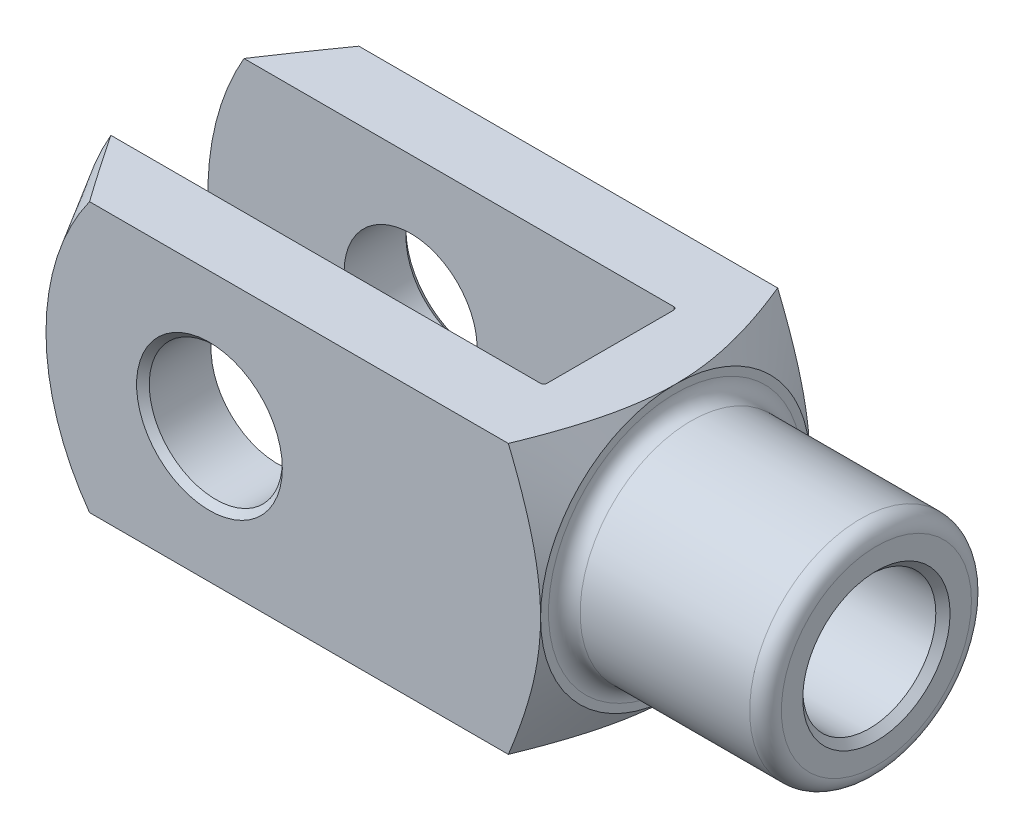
ISO-10303-21;
HEADER;
FILE_DESCRIPTION(('STEP AP214'),'2;1');
FILE_NAME('part.step','',(''),(''),'','','');
FILE_SCHEMA(('AUTOMOTIVE_DESIGN { 1 0 10303 214 1 1 1 1 }'));
ENDSEC;
DATA;
#1=APPLICATION_CONTEXT('core data for automotive mechanical design processes');
#2=APPLICATION_PROTOCOL_DEFINITION('international standard','automotive_design',2000,#1);
#3=PRODUCT_CONTEXT('',#1,'mechanical');
#4=PRODUCT('Part','Part','',(#3));
#5=PRODUCT_RELATED_PRODUCT_CATEGORY('part','',(#4));
#6=PRODUCT_DEFINITION_FORMATION('','',#4);
#7=PRODUCT_DEFINITION_CONTEXT('part definition',#1,'design');
#8=PRODUCT_DEFINITION('design','',#6,#7);
#9=PRODUCT_DEFINITION_SHAPE('','',#8);
#10=(LENGTH_UNIT() NAMED_UNIT(*) SI_UNIT(.MILLI.,.METRE.));
#11=(NAMED_UNIT(*) PLANE_ANGLE_UNIT() SI_UNIT($,.RADIAN.));
#12=(NAMED_UNIT(*) SI_UNIT($,.STERADIAN.) SOLID_ANGLE_UNIT());
#13=UNCERTAINTY_MEASURE_WITH_UNIT(LENGTH_MEASURE(1.E-05),#10,'distance_accuracy_value','');
#14=(GEOMETRIC_REPRESENTATION_CONTEXT(3) GLOBAL_UNCERTAINTY_ASSIGNED_CONTEXT((#13)) GLOBAL_UNIT_ASSIGNED_CONTEXT((#10,
#11,#12)) REPRESENTATION_CONTEXT('',''));
#15=CARTESIAN_POINT('',(0.,0.,0.));
#16=DIRECTION('',(0.,0.,1.));
#17=DIRECTION('',(1.,0.,0.));
#18=AXIS2_PLACEMENT_3D('',#15,#16,#17);
#19=CARTESIAN_POINT('',(-85.,-42.5,-20.));
#20=DIRECTION('',(0.,-1.,0.));
#21=DIRECTION('',(0.,0.,-1.));
#22=AXIS2_PLACEMENT_3D('',#19,#20,#21);
#23=CYLINDRICAL_SURFACE('',#22,1.);
#24=DIRECTION('',(0.,1.,0.));
#25=VECTOR('',#24,1.);
#26=CARTESIAN_POINT('',(-84.,-42.5,-20.));
#27=LINE('',#26,#25);
#28=CARTESIAN_POINT('',(-84.,-6.40312423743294,-20.));
#29=VERTEX_POINT('',#28);
#30=CARTESIAN_POINT('',(-84.,-42.5,-20.));
#31=VERTEX_POINT('',#30);
#32=EDGE_CURVE('E358',#29,#31,#27,.F.);
#33=ORIENTED_EDGE('',*,*,#32,.F.);
#34=CARTESIAN_POINT('',(-84.,-6.40312423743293,-20.));
#35=CARTESIAN_POINT('',(-84.0000045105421,-6.32329545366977,-20.0255578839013));
#36=CARTESIAN_POINT('',(-84.0009792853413,-6.24331961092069,-20.0506354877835));
#37=CARTESIAN_POINT('',(-84.0046878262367,-6.08311799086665,-20.099818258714));
#38=CARTESIAN_POINT('',(-84.0074214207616,-6.00289223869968,-20.1239235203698));
#39=CARTESIAN_POINT('',(-84.0179843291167,-5.76197794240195,-20.1947424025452));
#40=CARTESIAN_POINT('',(-84.0281762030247,-5.60095791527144,-20.2399893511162));
#41=CARTESIAN_POINT('',(-84.0537226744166,-5.27845034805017,-20.3264804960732));
#42=CARTESIAN_POINT('',(-84.0690718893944,-5.11696346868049,-20.367728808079));
#43=CARTESIAN_POINT('',(-84.1040755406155,-4.79347131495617,-20.4462796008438));
#44=CARTESIAN_POINT('',(-84.1237309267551,-4.63146593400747,-20.4835812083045));
#45=CARTESIAN_POINT('',(-84.1937852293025,-4.10148700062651,-20.5990155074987));
#46=CARTESIAN_POINT('',(-84.2515786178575,-3.73267093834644,-20.6689872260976));
#47=CARTESIAN_POINT('',(-84.3792336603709,-2.9938973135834,-20.7888622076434));
#48=CARTESIAN_POINT('',(-84.449100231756,-2.62393934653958,-20.8387572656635));
#49=CARTESIAN_POINT('',(-84.6698690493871,-1.51273253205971,-20.9586901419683));
#50=CARTESIAN_POINT('',(-84.8319442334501,-0.770126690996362,-20.9989808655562));
#51=CARTESIAN_POINT('',(-84.9958806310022,-0.0188774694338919,-20.9999936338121));
#52=CARTESIAN_POINT('',(-84.9979403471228,-0.00943866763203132,-20.9999999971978));
#53=CARTESIAN_POINT('',(-85.,0.,-21.));
#54=B_SPLINE_CURVE_WITH_KNOTS('',3,(#34,#35,#36,#37,#38,#39,#40,#41,#42,#43,#44,#45,#46,#47,#48,
#49,#50,#51,#52,#53),.UNSPECIFIED.,.F.,.F.,(4,2,2,2,2,2,2,2,2,4),(0.,0.251443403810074,
0.502862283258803,1.00540283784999,1.5074205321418,2.00954907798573,3.14800630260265,
4.28692832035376,6.56469795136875,6.59368071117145),.UNSPECIFIED.);
#55=CARTESIAN_POINT('',(-85.,0.,-21.));
#56=VERTEX_POINT('',#55);
#57=EDGE_CURVE('E390',#29,#56,#54,.T.);
#58=ORIENTED_EDGE('',*,*,#57,.T.);
#59=DIRECTION('',(0.,1.,0.));
#60=VECTOR('',#59,1.);
#61=CARTESIAN_POINT('',(-85.,42.5,-21.));
#62=LINE('',#61,#60);
#63=CARTESIAN_POINT('',(-85.,-42.5,-21.));
#64=VERTEX_POINT('',#63);
#65=EDGE_CURVE('E183',#64,#56,#62,.T.);
#66=ORIENTED_EDGE('',*,*,#65,.F.);
#67=CARTESIAN_POINT('',(-85.,-42.5,-20.));
#68=DIRECTION('',(0.,-1.,0.));
#69=DIRECTION('',(0.,0.,-1.));
#70=AXIS2_PLACEMENT_3D('',#67,#68,#69);
#71=CIRCLE('',#70,1.);
#72=EDGE_CURVE('E197',#31,#64,#71,.F.);
#73=ORIENTED_EDGE('',*,*,#72,.F.);
#74=EDGE_LOOP('',(#33,#58,#66,#73));
#75=FACE_BOUND('',#74,.T.);
#76=ADVANCED_FACE('F37',(#75),#23,.F.);
#77=CARTESIAN_POINT('',(-84.,-42.5,-21.));
#78=DIRECTION('',(1.,0.,0.));
#79=DIRECTION('',(0.,0.,-1.));
#80=AXIS2_PLACEMENT_3D('',#77,#78,#79);
#81=PLANE('',#80);
#82=CARTESIAN_POINT('',(-84.,42.5,-20.));
#83=VERTEX_POINT('',#82);
#84=CARTESIAN_POINT('',(-84.,6.40312423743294,-20.));
#85=VERTEX_POINT('',#84);
#86=EDGE_CURVE('E374',#83,#85,#27,.F.);
#87=ORIENTED_EDGE('',*,*,#86,.T.);
#88=CARTESIAN_POINT('',(-84.,0.,0.));
#89=DIRECTION('',(1.,0.,0.));
#90=DIRECTION('',(0.,0.,-1.));
#91=AXIS2_PLACEMENT_3D('',#88,#89,#90);
#92=CIRCLE('',#91,21.);
#93=CARTESIAN_POINT('',(-84.,6.40312423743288,20.));
#94=VERTEX_POINT('',#93);
#95=EDGE_CURVE('E440',#85,#94,#92,.T.);
#96=ORIENTED_EDGE('',*,*,#95,.T.);
#97=DIRECTION('',(0.,1.,0.));
#98=VECTOR('',#97,1.);
#99=CARTESIAN_POINT('',(-84.,42.5,20.));
#100=LINE('',#99,#98);
#101=CARTESIAN_POINT('',(-84.,42.5,20.));
#102=VERTEX_POINT('',#101);
#103=EDGE_CURVE('E160',#94,#102,#100,.T.);
#104=ORIENTED_EDGE('',*,*,#103,.T.);
#105=DIRECTION('',(0.,0.,-1.));
#106=VECTOR('',#105,1.);
#107=CARTESIAN_POINT('',(-84.,42.5,-21.));
#108=LINE('',#107,#106);
#109=EDGE_CURVE('E338',#102,#83,#108,.T.);
#110=ORIENTED_EDGE('',*,*,#109,.T.);
#111=EDGE_LOOP('',(#87,#96,#104,#110));
#112=FACE_BOUND('',#111,.T.);
#113=ADVANCED_FACE('F468',(#112),#81,.F.);
#114=CARTESIAN_POINT('',(-85.,-42.5,20.));
#115=DIRECTION('',(0.,-1.,0.));
#116=DIRECTION('',(0.,0.,-1.));
#117=AXIS2_PLACEMENT_3D('',#114,#115,#116);
#118=CYLINDRICAL_SURFACE('',#117,1.);
#119=ORIENTED_EDGE('',*,*,#103,.F.);
#120=CARTESIAN_POINT('',(-84.,6.40312423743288,20.));
#121=CARTESIAN_POINT('',(-84.0000045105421,6.32329545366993,20.0255578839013));
#122=CARTESIAN_POINT('',(-84.0009792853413,6.24331961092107,20.0506354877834));
#123=CARTESIAN_POINT('',(-84.0046878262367,6.08311799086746,20.0998182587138));
#124=CARTESIAN_POINT('',(-84.0074214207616,6.00289223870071,20.1239235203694));
#125=CARTESIAN_POINT('',(-84.0179843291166,5.76197794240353,20.1947424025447));
#126=CARTESIAN_POINT('',(-84.0281762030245,5.60095791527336,20.2399893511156));
#127=CARTESIAN_POINT('',(-84.0537226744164,5.27845034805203,20.3264804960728));
#128=CARTESIAN_POINT('',(-84.0690718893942,5.11696346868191,20.3677288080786));
#129=CARTESIAN_POINT('',(-84.1040755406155,4.79347131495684,20.4462796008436));
#130=CARTESIAN_POINT('',(-84.1237309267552,4.6314659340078,20.4835812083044));
#131=CARTESIAN_POINT('',(-84.1937852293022,4.10148700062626,20.5990155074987));
#132=CARTESIAN_POINT('',(-84.2515786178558,3.73267093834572,20.6689872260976));
#133=CARTESIAN_POINT('',(-84.3792336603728,2.99389731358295,20.7888622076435));
#134=CARTESIAN_POINT('',(-84.4491002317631,2.62393934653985,20.8387572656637));
#135=CARTESIAN_POINT('',(-84.6698690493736,1.51273253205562,20.9586901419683));
#136=CARTESIAN_POINT('',(-84.8319442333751,0.770126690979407,20.9989808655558));
#137=CARTESIAN_POINT('',(-84.9958806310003,0.0188774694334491,20.9999936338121));
#138=CARTESIAN_POINT('',(-84.9979403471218,0.0094386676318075,20.9999999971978));
#139=CARTESIAN_POINT('',(-85.,0.,21.));
#140=B_SPLINE_CURVE_WITH_KNOTS('',3,(#120,#121,#122,#123,#124,#125,#126,#127,#128,#129,#130,
#131,#132,#133,#134,#135,#136,#137,#138,#139),.UNSPECIFIED.,.F.,.F.,(4,2,2,2,2,2,2,2,2,4),(0.,
0.251443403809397,0.502862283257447,1.00540283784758,1.50742053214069,2.00954907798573,
3.14800630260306,4.28692832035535,6.56469795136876,6.59368071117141),.UNSPECIFIED.);
#141=CARTESIAN_POINT('',(-85.,0.,21.));
#142=VERTEX_POINT('',#141);
#143=EDGE_CURVE('E145',#94,#142,#140,.T.);
#144=ORIENTED_EDGE('',*,*,#143,.T.);
#145=DIRECTION('',(0.,1.,0.));
#146=VECTOR('',#145,1.);
#147=CARTESIAN_POINT('',(-85.,-42.5,21.));
#148=LINE('',#147,#146);
#149=CARTESIAN_POINT('',(-85.,42.5,21.));
#150=VERTEX_POINT('',#149);
#151=EDGE_CURVE('E159',#150,#142,#148,.F.);
#152=ORIENTED_EDGE('',*,*,#151,.F.);
#153=CARTESIAN_POINT('',(-85.,42.5,20.));
#154=DIRECTION('',(0.,1.,0.));
#155=DIRECTION('',(0.,0.,1.));
#156=AXIS2_PLACEMENT_3D('',#153,#154,#155);
#157=CIRCLE('',#156,1.);
#158=EDGE_CURVE('E190',#102,#150,#157,.F.);
#159=ORIENTED_EDGE('',*,*,#158,.F.);
#160=EDGE_LOOP('',(#119,#144,#152,#159));
#161=FACE_BOUND('',#160,.T.);
#162=ADVANCED_FACE('F156',(#161),#118,.F.);
#163=CARTESIAN_POINT('',(-232.,-42.5,-21.));
#164=DIRECTION('',(0.,0.,-1.));
#165=DIRECTION('',(-1.,0.,0.));
#166=AXIS2_PLACEMENT_3D('',#163,#164,#165);
#167=PLANE('',#166);
#168=CARTESIAN_POINT('',(-168.,0.,-21.));
#169=DIRECTION('',(0.,0.,-1.));
#170=DIRECTION('',(-1.,0.,0.));
#171=AXIS2_PLACEMENT_3D('',#168,#169,#170);
#172=CIRCLE('',#171,21.);
#173=CARTESIAN_POINT('',(-189.,0.,-21.));
#174=VERTEX_POINT('',#173);
#175=EDGE_CURVE('E368',#174,#174,#172,.F.);
#176=ORIENTED_EDGE('',*,*,#175,.F.);
#177=EDGE_LOOP('',(#176));
#178=FACE_BOUND('',#177,.T.);
#179=CARTESIAN_POINT('',(-147.,0.,-21.));
#180=DIRECTION('',(0.,0.,1.));
#181=DIRECTION('',(1.,0.,0.));
#182=AXIS2_PLACEMENT_3D('',#179,#180,#181);
#183=CIRCLE('',#182,85.);
#184=CARTESIAN_POINT('',(-220.612159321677,42.5,-21.));
#185=VERTEX_POINT('',#184);
#186=CARTESIAN_POINT('',(-220.612159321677,-42.5,-21.));
#187=VERTEX_POINT('',#186);
#188=EDGE_CURVE('E276',#185,#187,#183,.T.);
#189=ORIENTED_EDGE('',*,*,#188,.T.);
#190=DIRECTION('',(-1.,0.,0.));
#191=VECTOR('',#190,1.);
#192=CARTESIAN_POINT('',(-232.,-42.5,-21.));
#193=LINE('',#192,#191);
#194=EDGE_CURVE('E333',#64,#187,#193,.T.);
#195=ORIENTED_EDGE('',*,*,#194,.F.);
#196=ORIENTED_EDGE('',*,*,#65,.T.);
#197=CARTESIAN_POINT('',(-85.,42.5,-21.));
#198=VERTEX_POINT('',#197);
#199=EDGE_CURVE('E179',#56,#198,#62,.T.);
#200=ORIENTED_EDGE('',*,*,#199,.T.);
#201=DIRECTION('',(-1.,0.,0.));
#202=VECTOR('',#201,1.);
#203=CARTESIAN_POINT('',(-232.,42.5,-21.));
#204=LINE('',#203,#202);
#205=EDGE_CURVE('E346',#198,#185,#204,.T.);
#206=ORIENTED_EDGE('',*,*,#205,.T.);
#207=EDGE_LOOP('',(#189,#195,#196,#200,#206));
#208=FACE_BOUND('',#207,.T.);
#209=ADVANCED_FACE('F393',(#178,#208),#167,.F.);
#210=CARTESIAN_POINT('',(-232.,-42.5,21.));
#211=DIRECTION('',(0.,0.,1.));
#212=DIRECTION('',(1.,0.,0.));
#213=AXIS2_PLACEMENT_3D('',#210,#211,#212);
#214=PLANE('',#213);
#215=CARTESIAN_POINT('',(-168.,0.,21.));
#216=DIRECTION('',(0.,0.,1.));
#217=DIRECTION('',(1.,0.,0.));
#218=AXIS2_PLACEMENT_3D('',#215,#216,#217);
#219=CIRCLE('',#218,21.);
#220=CARTESIAN_POINT('',(-147.,0.,21.));
#221=VERTEX_POINT('',#220);
#222=EDGE_CURVE('E345',#221,#221,#219,.F.);
#223=ORIENTED_EDGE('',*,*,#222,.F.);
#224=EDGE_LOOP('',(#223));
#225=FACE_BOUND('',#224,.T.);
#226=DIRECTION('',(1.,0.,0.));
#227=VECTOR('',#226,1.);
#228=CARTESIAN_POINT('',(-232.,-42.5,21.));
#229=LINE('',#228,#227);
#230=CARTESIAN_POINT('',(-220.612159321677,-42.5,21.));
#231=VERTEX_POINT('',#230);
#232=CARTESIAN_POINT('',(-85.,-42.5,21.));
#233=VERTEX_POINT('',#232);
#234=EDGE_CURVE('E337',#231,#233,#229,.T.);
#235=ORIENTED_EDGE('',*,*,#234,.F.);
#236=CARTESIAN_POINT('',(-147.,0.,21.));
#237=DIRECTION('',(0.,0.,1.));
#238=DIRECTION('',(1.,0.,0.));
#239=AXIS2_PLACEMENT_3D('',#236,#237,#238);
#240=CIRCLE('',#239,85.);
#241=CARTESIAN_POINT('',(-220.612159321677,42.5,21.));
#242=VERTEX_POINT('',#241);
#243=EDGE_CURVE('E443',#242,#231,#240,.T.);
#244=ORIENTED_EDGE('',*,*,#243,.F.);
#245=DIRECTION('',(1.,0.,0.));
#246=VECTOR('',#245,1.);
#247=CARTESIAN_POINT('',(-232.,42.5,21.));
#248=LINE('',#247,#246);
#249=EDGE_CURVE('E176',#242,#150,#248,.T.);
#250=ORIENTED_EDGE('',*,*,#249,.T.);
#251=ORIENTED_EDGE('',*,*,#151,.T.);
#252=EDGE_CURVE('E164',#142,#233,#148,.F.);
#253=ORIENTED_EDGE('',*,*,#252,.T.);
#254=EDGE_LOOP('',(#235,#244,#250,#251,#253));
#255=FACE_BOUND('',#254,.T.);
#256=ADVANCED_FACE('F173',(#225,#255),#214,.F.);
#257=CARTESIAN_POINT('',(-232.,-42.5,42.5));
#258=DIRECTION('',(0.,0.,1.));
#259=DIRECTION('',(1.,0.,0.));
#260=AXIS2_PLACEMENT_3D('',#257,#258,#259);
#261=PLANE('',#260);
#262=CARTESIAN_POINT('',(-168.,0.,42.5));
#263=DIRECTION('',(0.,0.,1.));
#264=DIRECTION('',(1.,0.,0.));
#265=AXIS2_PLACEMENT_3D('',#262,#263,#264);
#266=CIRCLE('',#265,23.);
#267=CARTESIAN_POINT('',(-145.,0.,42.5));
#268=VERTEX_POINT('',#267);
#269=EDGE_CURVE('E228',#268,#268,#266,.F.);
#270=ORIENTED_EDGE('',*,*,#269,.T.);
#271=EDGE_LOOP('',(#270));
#272=FACE_BOUND('',#271,.T.);
#273=DIRECTION('',(1.,0.,0.));
#274=VECTOR('',#273,1.);
#275=CARTESIAN_POINT('',(-232.,42.5,42.5));
#276=LINE('',#275,#274);
#277=CARTESIAN_POINT('',(-205.844014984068,42.5,42.5));
#278=VERTEX_POINT('',#277);
#279=CARTESIAN_POINT('',(-73.6637182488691,42.5,42.5));
#280=VERTEX_POINT('',#279);
#281=EDGE_CURVE('E365',#278,#280,#276,.T.);
#282=ORIENTED_EDGE('',*,*,#281,.F.);
#283=CARTESIAN_POINT('',(-147.,0.,42.5));
#284=DIRECTION('',(0.,0.,1.));
#285=DIRECTION('',(1.,0.,0.));
#286=AXIS2_PLACEMENT_3D('',#283,#284,#285);
#287=CIRCLE('',#286,72.586969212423);
#288=CARTESIAN_POINT('',(-205.844014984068,-42.5,42.5));
#289=VERTEX_POINT('',#288);
#290=EDGE_CURVE('E61',#278,#289,#287,.T.);
#291=ORIENTED_EDGE('',*,*,#290,.T.);
#292=DIRECTION('',(1.,0.,0.));
#293=VECTOR('',#292,1.);
#294=CARTESIAN_POINT('',(-232.,-42.5,42.5));
#295=LINE('',#294,#293);
#296=CARTESIAN_POINT('',(-73.6637182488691,-42.5,42.5));
#297=VERTEX_POINT('',#296);
#298=EDGE_CURVE('E362',#289,#297,#295,.T.);
#299=ORIENTED_EDGE('',*,*,#298,.T.);
#300=CARTESIAN_POINT('',(-94.7624622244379,-86.802185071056,42.5));
#301=CARTESIAN_POINT('',(-94.2194099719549,-85.7548832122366,42.5));
#302=CARTESIAN_POINT('',(-93.6778422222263,-84.7068103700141,42.5));
#303=CARTESIAN_POINT('',(-92.5980017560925,-82.6089645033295,42.5));
#304=CARTESIAN_POINT('',(-92.0597290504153,-81.5591914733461,42.5));
#305=CARTESIAN_POINT('',(-90.9867800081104,-79.4577385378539,42.5));
#306=CARTESIAN_POINT('',(-90.4521038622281,-78.4060585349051,42.5));
#307=CARTESIAN_POINT('',(-89.3867656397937,-76.3006688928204,42.5));
#308=CARTESIAN_POINT('',(-88.8561035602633,-75.2469592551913,42.5));
#309=CARTESIAN_POINT('',(-87.2689305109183,-72.0788197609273,42.5));
#310=CARTESIAN_POINT('',(-86.2191025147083,-69.9610344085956,42.5));
#311=CARTESIAN_POINT('',(-84.1415102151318,-65.7146875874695,42.5));
#312=CARTESIAN_POINT('',(-83.1137455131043,-63.5861263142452,42.5));
#313=CARTESIAN_POINT('',(-81.5617563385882,-60.3176996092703,42.5));
#314=CARTESIAN_POINT('',(-81.0275478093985,-59.1825730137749,42.5));
#315=CARTESIAN_POINT('',(-79.9680476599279,-56.9081600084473,42.5));
#316=CARTESIAN_POINT('',(-79.442756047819,-55.7688735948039,42.5));
#317=CARTESIAN_POINT('',(-78.4023058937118,-53.4855999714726,42.5));
#318=CARTESIAN_POINT('',(-77.8871479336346,-52.3416124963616,42.5));
#319=CARTESIAN_POINT('',(-76.8684714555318,-50.0484628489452,42.5));
#320=CARTESIAN_POINT('',(-76.3649529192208,-48.8993006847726,42.5));
#321=CARTESIAN_POINT('',(-75.3715128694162,-46.5957089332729,42.5));
#322=CARTESIAN_POINT('',(-74.8815854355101,-45.4412819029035,42.5));
#323=CARTESIAN_POINT('',(-73.9171459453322,-43.125985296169,42.5));
#324=CARTESIAN_POINT('',(-73.4426340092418,-41.9651156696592,42.5));
#325=CARTESIAN_POINT('',(-72.5114996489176,-39.6363326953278,42.5));
#326=CARTESIAN_POINT('',(-72.0548755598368,-38.4684200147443,42.5));
#327=CARTESIAN_POINT('',(-71.1623541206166,-36.1247217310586,42.5));
#328=CARTESIAN_POINT('',(-70.7264562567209,-34.9489363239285,42.5));
#329=CARTESIAN_POINT('',(-69.7868235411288,-32.3328103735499,42.5));
#330=CARTESIAN_POINT('',(-69.2888706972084,-30.8903806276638,42.5));
#331=CARTESIAN_POINT('',(-68.3357729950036,-27.9913739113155,42.5));
#332=CARTESIAN_POINT('',(-67.8806281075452,-26.5347969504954,42.5));
#333=CARTESIAN_POINT('',(-67.021661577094,-23.606572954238,42.5));
#334=CARTESIAN_POINT('',(-66.6178366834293,-22.1349268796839,42.5));
#335=CARTESIAN_POINT('',(-65.8711311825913,-19.1761541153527,42.5));
#336=CARTESIAN_POINT('',(-65.5282498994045,-17.6890275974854,42.5));
#337=CARTESIAN_POINT('',(-64.9209851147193,-14.7349663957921,42.5));
#338=CARTESIAN_POINT('',(-64.6549478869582,-13.2683771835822,42.5));
#339=CARTESIAN_POINT('',(-64.3138855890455,-11.0596120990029,42.5));
#340=CARTESIAN_POINT('',(-64.2098605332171,-10.3218450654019,42.5));
#341=CARTESIAN_POINT('',(-64.0221574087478,-8.84373890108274,42.5));
#342=CARTESIAN_POINT('',(-63.9384783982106,-8.10339989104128,42.5));
#343=CARTESIAN_POINT('',(-63.7924057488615,-6.62108367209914,42.5));
#344=CARTESIAN_POINT('',(-63.7299989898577,-5.87910775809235,42.5));
#345=CARTESIAN_POINT('',(-63.627097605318,-4.39363091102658,42.5));
#346=CARTESIAN_POINT('',(-63.5866029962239,-3.65012997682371,42.5));
#347=CARTESIAN_POINT('',(-63.527999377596,-2.16226315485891,42.5));
#348=CARTESIAN_POINT('',(-63.5098897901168,-1.41789728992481,42.5));
#349=CARTESIAN_POINT('',(-63.4962705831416,0.0710389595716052,42.5));
#350=CARTESIAN_POINT('',(-63.5007608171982,0.815609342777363,42.5));
#351=CARTESIAN_POINT('',(-63.5311360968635,2.25000394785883,42.5));
#352=CARTESIAN_POINT('',(-63.5554376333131,2.93986229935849,42.5));
#353=CARTESIAN_POINT('',(-63.6231690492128,4.31866339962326,42.5));
#354=CARTESIAN_POINT('',(-63.6665996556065,5.00760611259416,42.5));
#355=CARTESIAN_POINT('',(-63.7721581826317,6.38402120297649,42.5));
#356=CARTESIAN_POINT('',(-63.8342851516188,7.07149365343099,42.5));
#357=CARTESIAN_POINT('',(-63.976638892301,8.4445713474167,42.5));
#358=CARTESIAN_POINT('',(-64.0568664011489,9.1301765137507,42.5));
#359=CARTESIAN_POINT('',(-64.3237239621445,11.1842300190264,42.5));
#360=CARTESIAN_POINT('',(-64.5364846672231,12.5493513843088,42.5));
#361=CARTESIAN_POINT('',(-65.0246976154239,15.2681897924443,42.5));
#362=CARTESIAN_POINT('',(-65.30015160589,16.6219065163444,42.5));
#363=CARTESIAN_POINT('',(-65.9148507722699,19.3558887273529,42.5));
#364=CARTESIAN_POINT('',(-66.2557115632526,20.7357885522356,42.5));
#365=CARTESIAN_POINT('',(-66.987473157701,23.482186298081,42.5));
#366=CARTESIAN_POINT('',(-67.3783744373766,24.8486840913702,42.5));
#367=CARTESIAN_POINT('',(-67.9965846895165,26.8886415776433,42.5));
#368=CARTESIAN_POINT('',(-68.207962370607,27.566989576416,42.5));
#369=CARTESIAN_POINT('',(-68.6405021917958,28.9205642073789,42.5));
#370=CARTESIAN_POINT('',(-68.861664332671,29.5957908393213,42.5));
#371=CARTESIAN_POINT('',(-69.3129567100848,30.9431916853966,42.5));
#372=CARTESIAN_POINT('',(-69.5430864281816,31.6153660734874,42.5));
#373=CARTESIAN_POINT('',(-70.0115928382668,32.9568269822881,42.5));
#374=CARTESIAN_POINT('',(-70.2499695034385,33.6261135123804,42.5));
#375=CARTESIAN_POINT('',(-71.0159037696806,35.7387134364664,42.5));
#376=CARTESIAN_POINT('',(-71.5573694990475,37.1769980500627,42.5));
#377=CARTESIAN_POINT('',(-72.6696994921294,40.0421880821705,42.5));
#378=CARTESIAN_POINT('',(-73.2405655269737,41.4690928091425,42.5));
#379=CARTESIAN_POINT('',(-74.4069494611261,44.3131447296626,42.5));
#380=CARTESIAN_POINT('',(-75.0024728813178,45.7302896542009,42.5));
#381=CARTESIAN_POINT('',(-76.2140693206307,48.5557146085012,42.5));
#382=CARTESIAN_POINT('',(-76.8301419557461,49.9639948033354,42.5));
#383=CARTESIAN_POINT('',(-78.0801587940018,52.7740443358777,42.5));
#384=CARTESIAN_POINT('',(-78.714117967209,54.1758070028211,42.5));
#385=CARTESIAN_POINT('',(-79.9967583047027,56.9725772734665,42.5));
#386=CARTESIAN_POINT('',(-80.6454395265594,58.3675848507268,42.5));
#387=CARTESIAN_POINT('',(-81.9552829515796,61.151528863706,42.5));
#388=CARTESIAN_POINT('',(-82.6164437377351,62.5404659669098,42.5));
#389=CARTESIAN_POINT('',(-83.9495345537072,65.3131546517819,42.5));
#390=CARTESIAN_POINT('',(-84.6214645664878,66.6969062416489,42.5));
#391=CARTESIAN_POINT('',(-85.9766807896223,69.4640622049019,42.5));
#392=CARTESIAN_POINT('',(-86.6599953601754,70.8474526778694,42.5));
#393=CARTESIAN_POINT('',(-88.0347375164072,73.6101941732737,42.5));
#394=CARTESIAN_POINT('',(-88.7261651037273,74.989545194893,42.5));
#395=CARTESIAN_POINT('',(-90.1161082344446,77.7447032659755,42.5));
#396=CARTESIAN_POINT('',(-90.8146239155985,79.1205102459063,42.5));
#397=CARTESIAN_POINT('',(-92.217863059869,81.8689559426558,42.5));
#398=CARTESIAN_POINT('',(-92.9225865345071,83.2415946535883,42.5));
#399=CARTESIAN_POINT('',(-95.0442272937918,87.3539331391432,42.5));
#400=CARTESIAN_POINT('',(-96.469306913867,90.0894231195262,42.5));
#401=CARTESIAN_POINT('',(-99.3365319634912,95.5514018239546,42.5));
#402=CARTESIAN_POINT('',(-100.778677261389,98.2778906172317,42.5));
#403=CARTESIAN_POINT('',(-103.461460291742,103.319219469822,42.5));
#404=CARTESIAN_POINT('',(-104.700217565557,105.635061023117,42.5));
#405=CARTESIAN_POINT('',(-107.186029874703,110.262287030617,42.5));
#406=CARTESIAN_POINT('',(-108.433084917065,112.573671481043,42.5));
#407=CARTESIAN_POINT('',(-110.934369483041,117.192973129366,42.5));
#408=CARTESIAN_POINT('',(-112.188599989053,119.500889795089,42.5));
#409=CARTESIAN_POINT('',(-114.70302010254,124.113474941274,42.5));
#410=CARTESIAN_POINT('',(-115.96320971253,126.418143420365,42.5));
#411=CARTESIAN_POINT('',(-118.481465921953,131.011484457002,42.5));
#412=CARTESIAN_POINT('',(-119.739503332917,133.300173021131,42.5));
#413=CARTESIAN_POINT('',(-122.259947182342,137.875143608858,42.5));
#414=CARTESIAN_POINT('',(-123.522353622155,140.16142563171,42.5));
#415=CARTESIAN_POINT('',(-126.050763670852,144.731527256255,42.5));
#416=CARTESIAN_POINT('',(-127.316766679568,147.015347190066,42.5));
#417=CARTESIAN_POINT('',(-129.852109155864,151.581131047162,42.5));
#418=CARTESIAN_POINT('',(-131.121448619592,153.863094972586,42.5));
#419=CARTESIAN_POINT('',(-132.392228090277,156.14425578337,42.5));
#420=B_SPLINE_CURVE_WITH_KNOTS('',3,(#300,#301,#302,#303,#304,#305,#306,#307,#308,#309,#310,
#311,#312,#313,#314,#315,#316,#317,#318,#319,#320,#321,#322,#323,#324,#325,#326,#327,#328,#329,
#330,#331,#332,#333,#334,#335,#336,#337,#338,#339,#340,#341,#342,#343,#344,#345,#346,#347,#348,
#349,#350,#351,#352,#353,#354,#355,#356,#357,#358,#359,#360,#361,#362,#363,#364,#365,#366,#367,
#368,#369,#370,#371,#372,#373,#374,#375,#376,#377,#378,#379,#380,#381,#382,#383,#384,#385,#386,
#387,#388,#389,#390,#391,#392,#393,#394,#395,#396,#397,#398,#399,#400,#401,#402,#403,#404,#405,
#406,#407,#408,#409,#410,#411,#412,#413,#414,#415,#416,#417,#418,#419),.UNSPECIFIED.,.F.,.F.,(4,
2,2,2,2,2,2,2,2,2,2,2,2,2,2,2,2,2,2,2,2,2,2,2,2,2,2,2,2,2,2,2,2,2,2,2,2,2,2,2,2,2,2,2,2,2,2,2,2,
2,2,2,2,2,2,2,2,2,2,4),(0.,3.53917010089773,7.0783517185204,10.6177195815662,14.1570848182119,
21.2481316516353,28.3390502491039,32.102663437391,35.8662800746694,39.6301122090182,
43.3939384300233,47.1560984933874,50.9182878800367,54.6801262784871,58.4418713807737,
63.0191904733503,67.5965064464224,72.1735323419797,76.7505074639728,81.2200421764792,
83.4550010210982,85.6898563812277,87.9233308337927,90.1568069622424,92.3902254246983,
94.623629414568,96.6942218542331,98.7648929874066,100.835458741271,102.906108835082,
107.049107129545,111.192220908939,115.455253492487,119.718326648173,121.849823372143,
123.981320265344,126.112694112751,128.244061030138,132.8541145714,137.464446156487,
142.075815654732,146.687099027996,151.30236351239,155.917646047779,160.53240765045,
165.147161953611,169.7759750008,174.404788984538,179.033693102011,183.662605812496,
192.915832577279,202.168988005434,210.047977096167,217.926972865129,225.807074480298,
233.68717942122,241.522145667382,249.357114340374,257.19084450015,265.024565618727),.UNSPECIFIED.);
#421=CARTESIAN_POINT('',(-63.5,0.,42.5));
#422=VERTEX_POINT('',#421);
#423=EDGE_CURVE('E305',#422,#297,#420,.F.);
#424=ORIENTED_EDGE('',*,*,#423,.F.);
#425=EDGE_CURVE('E303',#280,#422,#420,.F.);
#426=ORIENTED_EDGE('',*,*,#425,.F.);
#427=EDGE_LOOP('',(#282,#291,#299,#424,#426));
#428=FACE_BOUND('',#427,.T.);
#429=ADVANCED_FACE('F287',(#272,#428),#261,.T.);
#430=CARTESIAN_POINT('',(-232.,-42.5,42.5));
#431=DIRECTION('',(0.,-1.,0.));
#432=DIRECTION('',(0.,0.,-1.));
#433=AXIS2_PLACEMENT_3D('',#430,#431,#432);
#434=PLANE('',#433);
#435=ORIENTED_EDGE('',*,*,#194,.T.);
#436=CARTESIAN_POINT('',(-254.259121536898,-42.5,31.6063783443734));
#437=CARTESIAN_POINT('',(-253.224318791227,-42.5,29.9400996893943));
#438=CARTESIAN_POINT('',(-252.188060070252,-42.5,28.2747245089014));
#439=CARTESIAN_POINT('',(-250.11234990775,-42.5,24.9459626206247));
#440=CARTESIAN_POINT('',(-249.072898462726,-42.5,23.2825759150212));
#441=CARTESIAN_POINT('',(-246.990503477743,-42.5,19.9579428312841));
#442=CARTESIAN_POINT('',(-245.947559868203,-42.5,18.2966964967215));
#443=CARTESIAN_POINT('',(-243.857874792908,-42.5,14.9765951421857));
#444=CARTESIAN_POINT('',(-242.811133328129,-42.5,13.3177401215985));
#445=CARTESIAN_POINT('',(-239.662149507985,-42.5,8.34111474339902));
#446=CARTESIAN_POINT('',(-237.553657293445,-42.5,5.02729451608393));
#447=CARTESIAN_POINT('',(-233.316537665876,-42.5,-1.58742420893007));
#448=CARTESIAN_POINT('',(-231.18791042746,-42.5,-4.88832281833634));
#449=CARTESIAN_POINT('',(-227.93107397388,-42.5,-9.89719201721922));
#450=CARTESIAN_POINT('',(-226.811906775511,-42.5,-11.6110434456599));
#451=CARTESIAN_POINT('',(-224.565991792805,-42.5,-15.0337706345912));
#452=CARTESIAN_POINT('',(-223.439244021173,-42.5,-16.7426464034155));
#453=CARTESIAN_POINT('',(-221.177182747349,-42.5,-20.1547865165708));
#454=CARTESIAN_POINT('',(-220.041869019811,-42.5,-21.8580507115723));
#455=CARTESIAN_POINT('',(-217.761573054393,-42.5,-25.2580964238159));
#456=CARTESIAN_POINT('',(-216.616590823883,-42.5,-26.9548779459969));
#457=CARTESIAN_POINT('',(-214.316494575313,-42.5,-30.3396627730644));
#458=CARTESIAN_POINT('',(-213.161389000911,-42.5,-32.0276718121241));
#459=CARTESIAN_POINT('',(-210.838567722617,-42.5,-35.3950071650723));
#460=CARTESIAN_POINT('',(-209.670851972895,-42.5,-37.0743334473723));
#461=CARTESIAN_POINT('',(-207.320923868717,-42.5,-40.4227045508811));
#462=CARTESIAN_POINT('',(-206.138712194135,-42.5,-42.0917498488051));
#463=CARTESIAN_POINT('',(-203.757375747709,-42.5,-45.4177189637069));
#464=CARTESIAN_POINT('',(-202.558251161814,-42.5,-47.0746429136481));
#465=CARTESIAN_POINT('',(-200.1515804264,-42.5,-50.3583415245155));
#466=CARTESIAN_POINT('',(-198.944221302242,-42.5,-51.9852531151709));
#467=CARTESIAN_POINT('',(-196.506431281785,-42.5,-55.2217982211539));
#468=CARTESIAN_POINT('',(-195.275999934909,-42.5,-56.8314313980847));
#469=CARTESIAN_POINT('',(-193.408811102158,-42.5,-59.2309169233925));
#470=CARTESIAN_POINT('',(-192.782375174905,-42.5,-60.0288087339));
#471=CARTESIAN_POINT('',(-191.5218982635,-42.5,-61.6185589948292));
#472=CARTESIAN_POINT('',(-190.887857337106,-42.5,-62.4104174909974));
#473=CARTESIAN_POINT('',(-189.611424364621,-42.5,-63.9873278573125));
#474=CARTESIAN_POINT('',(-188.969032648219,-42.5,-64.7723799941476));
#475=CARTESIAN_POINT('',(-187.674999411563,-42.5,-66.334814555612));
#476=CARTESIAN_POINT('',(-187.02335800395,-42.5,-67.1121970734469));
#477=CARTESIAN_POINT('',(-185.716751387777,-42.5,-68.6500819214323));
#478=CARTESIAN_POINT('',(-185.061894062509,-42.5,-69.4106758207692));
#479=CARTESIAN_POINT('',(-183.741010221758,-42.5,-70.9221195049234));
#480=CARTESIAN_POINT('',(-183.074983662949,-42.5,-71.6729692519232));
#481=CARTESIAN_POINT('',(-181.730291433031,-42.5,-73.1636617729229));
#482=CARTESIAN_POINT('',(-181.051622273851,-42.5,-73.9035014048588));
#483=CARTESIAN_POINT('',(-179.680353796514,-42.5,-75.3701645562));
#484=CARTESIAN_POINT('',(-178.987754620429,-42.5,-76.0969882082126));
#485=CARTESIAN_POINT('',(-177.588511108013,-42.5,-77.5337968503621));
#486=CARTESIAN_POINT('',(-176.881902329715,-42.5,-78.243816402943));
#487=CARTESIAN_POINT('',(-175.451135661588,-42.5,-79.6460631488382));
#488=CARTESIAN_POINT('',(-174.726976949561,-42.5,-80.3382895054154));
#489=CARTESIAN_POINT('',(-173.259343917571,-42.5,-81.7011492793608));
#490=CARTESIAN_POINT('',(-172.515880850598,-42.5,-82.3717947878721));
#491=CARTESIAN_POINT('',(-171.006813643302,-42.5,-83.6876063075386));
#492=CARTESIAN_POINT('',(-170.241212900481,-42.5,-84.3327761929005));
#493=CARTESIAN_POINT('',(-169.063354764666,-42.5,-85.2860837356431));
#494=CARTESIAN_POINT('',(-168.660270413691,-42.5,-85.605583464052));
#495=CARTESIAN_POINT('',(-167.8470950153,-42.5,-86.2355559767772));
#496=CARTESIAN_POINT('',(-167.437003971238,-42.5,-86.5460287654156));
#497=CARTESIAN_POINT('',(-166.609319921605,-42.5,-87.1570274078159));
#498=CARTESIAN_POINT('',(-166.191725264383,-42.5,-87.4575510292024));
#499=CARTESIAN_POINT('',(-165.348737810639,-42.5,-88.0474343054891));
#500=CARTESIAN_POINT('',(-164.923345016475,-42.5,-88.3367939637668));
#501=CARTESIAN_POINT('',(-163.635508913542,-42.5,-89.1858557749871));
#502=CARTESIAN_POINT('',(-162.760703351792,-42.5,-89.7270659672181));
#503=CARTESIAN_POINT('',(-160.975814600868,-42.5,-90.7479148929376));
#504=CARTESIAN_POINT('',(-160.065740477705,-42.5,-91.2275693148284));
#505=CARTESIAN_POINT('',(-158.41697160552,-42.5,-92.0117689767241));
#506=CARTESIAN_POINT('',(-157.685513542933,-42.5,-92.3314779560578));
#507=CARTESIAN_POINT('',(-156.201249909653,-42.5,-92.917125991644));
#508=CARTESIAN_POINT('',(-155.448446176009,-42.5,-93.1830696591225));
#509=CARTESIAN_POINT('',(-153.924642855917,-42.5,-93.6527486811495));
#510=CARTESIAN_POINT('',(-153.15367010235,-42.5,-93.8565702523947));
#511=CARTESIAN_POINT('',(-151.596542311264,-42.5,-94.1949605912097));
#512=CARTESIAN_POINT('',(-150.810387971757,-42.5,-94.3295325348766));
#513=CARTESIAN_POINT('',(-149.220937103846,-42.5,-94.5246248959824));
#514=CARTESIAN_POINT('',(-148.417547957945,-42.5,-94.5844008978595));
#515=CARTESIAN_POINT('',(-146.808795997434,-42.5,-94.6245958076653));
#516=CARTESIAN_POINT('',(-146.003433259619,-42.5,-94.60501775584));
#517=CARTESIAN_POINT('',(-144.398340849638,-42.5,-94.4874466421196));
#518=CARTESIAN_POINT('',(-143.59861244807,-42.5,-94.3894364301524));
#519=CARTESIAN_POINT('',(-142.011788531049,-42.5,-94.1194965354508));
#520=CARTESIAN_POINT('',(-141.224695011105,-42.5,-93.9475552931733));
#521=CARTESIAN_POINT('',(-139.521111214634,-42.5,-93.4978686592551));
#522=CARTESIAN_POINT('',(-138.608292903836,-42.5,-93.2062652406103));
#523=CARTESIAN_POINT('',(-136.812725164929,-42.5,-92.5422203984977));
#524=CARTESIAN_POINT('',(-135.929985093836,-42.5,-92.169754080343));
#525=CARTESIAN_POINT('',(-134.193516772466,-42.5,-91.3564797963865));
#526=CARTESIAN_POINT('',(-133.339885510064,-42.5,-90.9154662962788));
#527=CARTESIAN_POINT('',(-132.082993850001,-42.5,-90.2125894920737));
#528=CARTESIAN_POINT('',(-131.667958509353,-42.5,-89.9714062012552));
#529=CARTESIAN_POINT('',(-130.845395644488,-42.5,-89.4765094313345));
#530=CARTESIAN_POINT('',(-130.437868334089,-42.5,-89.2227955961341));
#531=CARTESIAN_POINT('',(-129.495749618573,-42.5,-88.6178079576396));
#532=CARTESIAN_POINT('',(-128.963974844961,-42.5,-88.2621504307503));
#533=CARTESIAN_POINT('',(-127.912557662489,-42.5,-87.5332717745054));
#534=CARTESIAN_POINT('',(-127.392916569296,-42.5,-87.160048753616));
#535=CARTESIAN_POINT('',(-126.364842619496,-42.5,-86.3980920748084));
#536=CARTESIAN_POINT('',(-125.856414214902,-42.5,-86.0093524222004));
#537=CARTESIAN_POINT('',(-124.850167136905,-42.5,-85.2183409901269));
#538=CARTESIAN_POINT('',(-124.352349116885,-42.5,-84.8160683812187));
#539=CARTESIAN_POINT('',(-123.365687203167,-42.5,-83.9988596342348));
#540=CARTESIAN_POINT('',(-122.87686150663,-42.5,-83.5839015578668));
#541=CARTESIAN_POINT('',(-121.908395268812,-42.5,-82.7433882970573));
#542=CARTESIAN_POINT('',(-121.428755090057,-42.5,-82.3178326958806));
#543=CARTESIAN_POINT('',(-120.002808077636,-42.5,-81.0272915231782));
#544=CARTESIAN_POINT('',(-119.069222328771,-42.5,-80.148220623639));
#545=CARTESIAN_POINT('',(-117.225141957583,-42.5,-78.3542980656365));
#546=CARTESIAN_POINT('',(-116.314842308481,-42.5,-77.4392472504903));
#547=CARTESIAN_POINT('',(-114.519610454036,-42.5,-75.584585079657));
#548=CARTESIAN_POINT('',(-113.63467919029,-42.5,-74.6449728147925));
#549=CARTESIAN_POINT('',(-111.887660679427,-42.5,-72.7466100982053));
#550=CARTESIAN_POINT('',(-111.025550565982,-42.5,-71.7878806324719));
#551=CARTESIAN_POINT('',(-109.320349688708,-42.5,-69.8537259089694));
#552=CARTESIAN_POINT('',(-108.477258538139,-42.5,-68.8783009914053));
#553=CARTESIAN_POINT('',(-106.478662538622,-42.5,-66.5262542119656));
#554=CARTESIAN_POINT('',(-105.330964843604,-42.5,-65.1430027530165));
#555=CARTESIAN_POINT('',(-103.062189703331,-42.5,-62.3544537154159));
#556=CARTESIAN_POINT('',(-101.941117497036,-42.5,-60.9491518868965));
#557=CARTESIAN_POINT('',(-100.284893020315,-42.5,-58.8385608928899));
#558=CARTESIAN_POINT('',(-99.7411486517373,-42.5,-58.1399899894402));
#559=CARTESIAN_POINT('',(-98.6587397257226,-42.5,-56.7389200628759));
#560=CARTESIAN_POINT('',(-98.1200751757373,-42.5,-56.0364210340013));
#561=CARTESIAN_POINT('',(-97.0475991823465,-42.5,-54.6280587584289));
#562=CARTESIAN_POINT('',(-96.5137863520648,-42.5,-53.9221965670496));
#563=CARTESIAN_POINT('',(-95.450520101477,-42.5,-52.5072061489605));
#564=CARTESIAN_POINT('',(-94.9210666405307,-42.5,-51.7980779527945));
#565=CARTESIAN_POINT('',(-94.3936216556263,-42.5,-51.087462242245));
#566=B_SPLINE_CURVE_WITH_KNOTS('',3,(#436,#437,#438,#439,#440,#441,#442,#443,#444,#445,#446,
#447,#448,#449,#450,#451,#452,#453,#454,#455,#456,#457,#458,#459,#460,#461,#462,#463,#464,#465,
#466,#467,#468,#469,#470,#471,#472,#473,#474,#475,#476,#477,#478,#479,#480,#481,#482,#483,#484,
#485,#486,#487,#488,#489,#490,#491,#492,#493,#494,#495,#496,#497,#498,#499,#500,#501,#502,#503,
#504,#505,#506,#507,#508,#509,#510,#511,#512,#513,#514,#515,#516,#517,#518,#519,#520,#521,#522,
#523,#524,#525,#526,#527,#528,#529,#530,#531,#532,#533,#534,#535,#536,#537,#538,#539,#540,#541,
#542,#543,#544,#545,#546,#547,#548,#549,#550,#551,#552,#553,#554,#555,#556,#557,#558,#559,#560,
#561,#562,#563,#564,#565),.UNSPECIFIED.,.F.,.F.,(4,2,2,2,2,2,2,2,2,2,2,2,2,2,2,2,2,2,2,2,2,2,2,
2,2,2,2,2,2,2,2,2,2,2,2,2,2,2,2,2,2,2,2,2,2,2,2,2,2,2,2,2,2,2,2,2,2,2,2,2,2,2,2,2,4),(0.,
5.88436173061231,11.7687299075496,17.6532160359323,23.5377006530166,35.3208624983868,
47.1039222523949,53.2446222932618,59.3853120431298,65.5261639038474,71.6670110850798,
77.8031487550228,83.9393087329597,90.0751820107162,96.210987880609,102.28873999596,
108.366610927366,111.409841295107,114.453048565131,117.496136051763,120.539186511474,
123.550081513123,126.560988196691,129.572738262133,132.584457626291,135.58932171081,
138.594326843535,141.597617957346,144.600450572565,146.143399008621,147.686346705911,
149.229638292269,150.772929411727,153.856879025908,156.940041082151,159.333073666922,
161.725900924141,164.115391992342,166.504773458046,168.91775112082,171.330636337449,
173.744049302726,176.157839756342,179.028011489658,181.899068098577,184.778905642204,
186.218805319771,187.658745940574,189.577574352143,191.496609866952,193.416394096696,
195.336296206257,197.259730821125,199.183241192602,203.02927574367,206.900900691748,
210.772669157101,214.64039887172,218.508049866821,223.899775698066,229.292553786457,
231.948271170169,234.603992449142,237.258929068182,239.913840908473),.UNSPECIFIED.);
#567=CARTESIAN_POINT('',(-205.844014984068,-42.5,-42.5));
#568=VERTEX_POINT('',#567);
#569=EDGE_CURVE('E275',#187,#568,#566,.T.);
#570=ORIENTED_EDGE('',*,*,#569,.T.);
#571=DIRECTION('',(1.,0.,0.));
#572=VECTOR('',#571,1.);
#573=CARTESIAN_POINT('',(-232.,-42.5,-42.5));
#574=LINE('',#573,#572);
#575=CARTESIAN_POINT('',(-73.6637182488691,-42.5,-42.5));
#576=VERTEX_POINT('',#575);
#577=EDGE_CURVE('E359',#568,#576,#574,.T.);
#578=ORIENTED_EDGE('',*,*,#577,.T.);
#579=CARTESIAN_POINT('',(-94.7624622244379,-42.5,-86.802185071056));
#580=CARTESIAN_POINT('',(-94.2194099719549,-42.5,-85.7548832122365));
#581=CARTESIAN_POINT('',(-93.6778422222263,-42.5,-84.706810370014));
#582=CARTESIAN_POINT('',(-92.5980017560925,-42.5,-82.6089645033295));
#583=CARTESIAN_POINT('',(-92.0597290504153,-42.5,-81.5591914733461));
#584=CARTESIAN_POINT('',(-90.9867800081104,-42.5,-79.4577385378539));
#585=CARTESIAN_POINT('',(-90.4521038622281,-42.5,-78.4060585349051));
#586=CARTESIAN_POINT('',(-89.3867656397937,-42.5,-76.3006688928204));
#587=CARTESIAN_POINT('',(-88.8561035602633,-42.5,-75.2469592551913));
#588=CARTESIAN_POINT('',(-87.2689305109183,-42.5,-72.0788197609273));
#589=CARTESIAN_POINT('',(-86.2191025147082,-42.5,-69.9610344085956));
#590=CARTESIAN_POINT('',(-84.1415102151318,-42.5,-65.7146875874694));
#591=CARTESIAN_POINT('',(-83.1137455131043,-42.5,-63.5861263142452));
#592=CARTESIAN_POINT('',(-81.5617563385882,-42.5,-60.3176996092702));
#593=CARTESIAN_POINT('',(-81.0275478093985,-42.5,-59.1825730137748));
#594=CARTESIAN_POINT('',(-79.9680476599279,-42.5,-56.9081600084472));
#595=CARTESIAN_POINT('',(-79.442756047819,-42.5,-55.7688735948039));
#596=CARTESIAN_POINT('',(-78.4023058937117,-42.5,-53.4855999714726));
#597=CARTESIAN_POINT('',(-77.8871479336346,-42.5,-52.3416124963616));
#598=CARTESIAN_POINT('',(-76.8684714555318,-42.5,-50.0484628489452));
#599=CARTESIAN_POINT('',(-76.3649529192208,-42.5,-48.8993006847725));
#600=CARTESIAN_POINT('',(-75.3715128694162,-42.5,-46.5957089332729));
#601=CARTESIAN_POINT('',(-74.8815854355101,-42.5,-45.4412819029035));
#602=CARTESIAN_POINT('',(-73.9171459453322,-42.5,-43.125985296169));
#603=CARTESIAN_POINT('',(-73.4426340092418,-42.5,-41.9651156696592));
#604=CARTESIAN_POINT('',(-72.5114996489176,-42.5,-39.6363326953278));
#605=CARTESIAN_POINT('',(-72.0548755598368,-42.5,-38.4684200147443));
#606=CARTESIAN_POINT('',(-71.1623541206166,-42.5,-36.1247217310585));
#607=CARTESIAN_POINT('',(-70.7264562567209,-42.5,-34.9489363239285));
#608=CARTESIAN_POINT('',(-69.7868235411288,-42.5,-32.3328103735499));
#609=CARTESIAN_POINT('',(-69.2888706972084,-42.5,-30.8903806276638));
#610=CARTESIAN_POINT('',(-68.3357729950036,-42.5,-27.9913739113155));
#611=CARTESIAN_POINT('',(-67.8806281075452,-42.5,-26.5347969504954));
#612=CARTESIAN_POINT('',(-67.021661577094,-42.5,-23.606572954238));
#613=CARTESIAN_POINT('',(-66.6178366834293,-42.5,-22.1349268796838));
#614=CARTESIAN_POINT('',(-65.8711311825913,-42.5,-19.1761541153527));
#615=CARTESIAN_POINT('',(-65.5282498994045,-42.5,-17.6890275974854));
#616=CARTESIAN_POINT('',(-64.9209851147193,-42.5,-14.7349663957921));
#617=CARTESIAN_POINT('',(-64.6549478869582,-42.5,-13.2683771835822));
#618=CARTESIAN_POINT('',(-64.3138855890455,-42.5,-11.0596120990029));
#619=CARTESIAN_POINT('',(-64.2098605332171,-42.5,-10.3218450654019));
#620=CARTESIAN_POINT('',(-64.0221574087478,-42.5,-8.84373890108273));
#621=CARTESIAN_POINT('',(-63.9384783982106,-42.5,-8.10339989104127));
#622=CARTESIAN_POINT('',(-63.7924057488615,-42.5,-6.62108367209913));
#623=CARTESIAN_POINT('',(-63.7299989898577,-42.5,-5.87910775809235));
#624=CARTESIAN_POINT('',(-63.627097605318,-42.5,-4.39363091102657));
#625=CARTESIAN_POINT('',(-63.5866029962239,-42.5,-3.6501299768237));
#626=CARTESIAN_POINT('',(-63.527999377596,-42.5,-2.16226315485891));
#627=CARTESIAN_POINT('',(-63.5098897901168,-42.5,-1.4178972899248));
#628=CARTESIAN_POINT('',(-63.4962705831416,-42.5,0.0710389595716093));
#629=CARTESIAN_POINT('',(-63.5007608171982,-42.5,0.815609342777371));
#630=CARTESIAN_POINT('',(-63.5311360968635,-42.5,2.25000394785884));
#631=CARTESIAN_POINT('',(-63.5554376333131,-42.5,2.9398622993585));
#632=CARTESIAN_POINT('',(-63.6231690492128,-42.5,4.31866339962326));
#633=CARTESIAN_POINT('',(-63.6665996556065,-42.5,5.00760611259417));
#634=CARTESIAN_POINT('',(-63.7721581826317,-42.5,6.38402120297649));
#635=CARTESIAN_POINT('',(-63.8342851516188,-42.5,7.07149365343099));
#636=CARTESIAN_POINT('',(-63.976638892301,-42.5,8.4445713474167));
#637=CARTESIAN_POINT('',(-64.0568664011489,-42.5,9.1301765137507));
#638=CARTESIAN_POINT('',(-64.3237239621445,-42.5,11.1842300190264));
#639=CARTESIAN_POINT('',(-64.5364846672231,-42.5,12.5493513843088));
#640=CARTESIAN_POINT('',(-65.0246976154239,-42.5,15.2681897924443));
#641=CARTESIAN_POINT('',(-65.30015160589,-42.5,16.6219065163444));
#642=CARTESIAN_POINT('',(-65.9148507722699,-42.5,19.3558887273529));
#643=CARTESIAN_POINT('',(-66.2557115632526,-42.5,20.7357885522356));
#644=CARTESIAN_POINT('',(-66.987473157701,-42.5,23.482186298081));
#645=CARTESIAN_POINT('',(-67.3783744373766,-42.5,24.8486840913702));
#646=CARTESIAN_POINT('',(-67.9965846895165,-42.5,26.8886415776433));
#647=CARTESIAN_POINT('',(-68.207962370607,-42.5,27.566989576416));
#648=CARTESIAN_POINT('',(-68.6405021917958,-42.5,28.9205642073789));
#649=CARTESIAN_POINT('',(-68.861664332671,-42.5,29.5957908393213));
#650=CARTESIAN_POINT('',(-69.3129567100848,-42.5,30.9431916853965));
#651=CARTESIAN_POINT('',(-69.5430864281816,-42.5,31.6153660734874));
#652=CARTESIAN_POINT('',(-70.0115928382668,-42.5,32.9568269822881));
#653=CARTESIAN_POINT('',(-70.2499695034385,-42.5,33.6261135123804));
#654=CARTESIAN_POINT('',(-71.0159037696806,-42.5,35.7387134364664));
#655=CARTESIAN_POINT('',(-71.5573694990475,-42.5,37.1769980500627));
#656=CARTESIAN_POINT('',(-72.6696994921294,-42.5,40.0421880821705));
#657=CARTESIAN_POINT('',(-73.2405655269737,-42.5,41.4690928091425));
#658=CARTESIAN_POINT('',(-74.4069494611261,-42.5,44.3131447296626));
#659=CARTESIAN_POINT('',(-75.0024728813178,-42.5,45.7302896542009));
#660=CARTESIAN_POINT('',(-76.2140693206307,-42.5,48.5557146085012));
#661=CARTESIAN_POINT('',(-76.8301419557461,-42.5,49.9639948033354));
#662=CARTESIAN_POINT('',(-78.0801587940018,-42.5,52.7740443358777));
#663=CARTESIAN_POINT('',(-78.714117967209,-42.5,54.1758070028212));
#664=CARTESIAN_POINT('',(-79.9967583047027,-42.5,56.9725772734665));
#665=CARTESIAN_POINT('',(-80.6454395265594,-42.5,58.3675848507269));
#666=CARTESIAN_POINT('',(-81.9552829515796,-42.5,61.151528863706));
#667=CARTESIAN_POINT('',(-82.6164437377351,-42.5,62.5404659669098));
#668=CARTESIAN_POINT('',(-83.9495345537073,-42.5,65.3131546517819));
#669=CARTESIAN_POINT('',(-84.6214645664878,-42.5,66.696906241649));
#670=CARTESIAN_POINT('',(-85.9766807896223,-42.5,69.4640622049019));
#671=CARTESIAN_POINT('',(-86.6599953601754,-42.5,70.8474526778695));
#672=CARTESIAN_POINT('',(-88.0347375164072,-42.5,73.6101941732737));
#673=CARTESIAN_POINT('',(-88.7261651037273,-42.5,74.9895451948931));
#674=CARTESIAN_POINT('',(-90.1161082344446,-42.5,77.7447032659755));
#675=CARTESIAN_POINT('',(-90.8146239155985,-42.5,79.1205102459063));
#676=CARTESIAN_POINT('',(-92.217863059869,-42.5,81.8689559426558));
#677=CARTESIAN_POINT('',(-92.9225865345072,-42.5,83.2415946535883));
#678=CARTESIAN_POINT('',(-95.0442272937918,-42.5,87.3539331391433));
#679=CARTESIAN_POINT('',(-96.469306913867,-42.5,90.0894231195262));
#680=CARTESIAN_POINT('',(-99.3365319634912,-42.5,95.5514018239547));
#681=CARTESIAN_POINT('',(-100.778677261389,-42.5,98.2778906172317));
#682=CARTESIAN_POINT('',(-103.461460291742,-42.5,103.319219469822));
#683=CARTESIAN_POINT('',(-104.700217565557,-42.5,105.635061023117));
#684=CARTESIAN_POINT('',(-107.186029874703,-42.5,110.262287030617));
#685=CARTESIAN_POINT('',(-108.433084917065,-42.5,112.573671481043));
#686=CARTESIAN_POINT('',(-110.934369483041,-42.5,117.192973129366));
#687=CARTESIAN_POINT('',(-112.188599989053,-42.5,119.500889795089));
#688=CARTESIAN_POINT('',(-114.70302010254,-42.5,124.113474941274));
#689=CARTESIAN_POINT('',(-115.96320971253,-42.5,126.418143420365));
#690=CARTESIAN_POINT('',(-118.481465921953,-42.5,131.011484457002));
#691=CARTESIAN_POINT('',(-119.739503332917,-42.5,133.300173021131));
#692=CARTESIAN_POINT('',(-122.259947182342,-42.5,137.875143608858));
#693=CARTESIAN_POINT('',(-123.522353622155,-42.5,140.16142563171));
#694=CARTESIAN_POINT('',(-126.050763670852,-42.5,144.731527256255));
#695=CARTESIAN_POINT('',(-127.316766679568,-42.5,147.015347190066));
#696=CARTESIAN_POINT('',(-129.852109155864,-42.5,151.581131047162));
#697=CARTESIAN_POINT('',(-131.121448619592,-42.5,153.863094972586));
#698=CARTESIAN_POINT('',(-132.392228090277,-42.5,156.14425578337));
#699=B_SPLINE_CURVE_WITH_KNOTS('',3,(#579,#580,#581,#582,#583,#584,#585,#586,#587,#588,#589,
#590,#591,#592,#593,#594,#595,#596,#597,#598,#599,#600,#601,#602,#603,#604,#605,#606,#607,#608,
#609,#610,#611,#612,#613,#614,#615,#616,#617,#618,#619,#620,#621,#622,#623,#624,#625,#626,#627,
#628,#629,#630,#631,#632,#633,#634,#635,#636,#637,#638,#639,#640,#641,#642,#643,#644,#645,#646,
#647,#648,#649,#650,#651,#652,#653,#654,#655,#656,#657,#658,#659,#660,#661,#662,#663,#664,#665,
#666,#667,#668,#669,#670,#671,#672,#673,#674,#675,#676,#677,#678,#679,#680,#681,#682,#683,#684,
#685,#686,#687,#688,#689,#690,#691,#692,#693,#694,#695,#696,#697,#698),.UNSPECIFIED.,.F.,.F.,(4,
2,2,2,2,2,2,2,2,2,2,2,2,2,2,2,2,2,2,2,2,2,2,2,2,2,2,2,2,2,2,2,2,2,2,2,2,2,2,2,2,2,2,2,2,2,2,2,2,
2,2,2,2,2,2,2,2,2,2,4),(0.,3.53917010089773,7.0783517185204,10.6177195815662,14.1570848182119,
21.2481316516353,28.3390502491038,32.102663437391,35.8662800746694,39.6301122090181,
43.3939384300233,47.1560984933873,50.9182878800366,54.680126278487,58.4418713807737,
63.0191904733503,67.5965064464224,72.1735323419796,76.7505074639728,81.2200421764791,
83.4550010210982,85.6898563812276,87.9233308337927,90.1568069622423,92.3902254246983,
94.623629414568,96.6942218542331,98.7648929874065,100.835458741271,102.906108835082,
107.049107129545,111.192220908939,115.455253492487,119.718326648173,121.849823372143,
123.981320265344,126.112694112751,128.244061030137,132.8541145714,137.464446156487,
142.075815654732,146.687099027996,151.30236351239,155.917646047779,160.53240765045,
165.147161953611,169.7759750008,174.404788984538,179.033693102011,183.662605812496,
192.915832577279,202.168988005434,210.047977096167,217.926972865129,225.807074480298,
233.68717942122,241.522145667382,249.357114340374,257.19084450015,265.024565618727),.UNSPECIFIED.);
#700=CARTESIAN_POINT('',(-63.5,-42.5,0.));
#701=VERTEX_POINT('',#700);
#702=EDGE_CURVE('E304',#701,#576,#699,.F.);
#703=ORIENTED_EDGE('',*,*,#702,.F.);
#704=EDGE_CURVE('E295',#297,#701,#699,.F.);
#705=ORIENTED_EDGE('',*,*,#704,.F.);
#706=ORIENTED_EDGE('',*,*,#298,.F.);
#707=CARTESIAN_POINT('',(-94.3936216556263,-42.5,51.0874622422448));
#708=CARTESIAN_POINT('',(-94.8248870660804,-42.5,51.668504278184));
#709=CARTESIAN_POINT('',(-95.2574981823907,-42.5,52.2485467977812));
#710=CARTESIAN_POINT('',(-96.1255935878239,-42.5,53.4064823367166));
#711=CARTESIAN_POINT('',(-96.5610778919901,-42.5,53.9843753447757));
#712=CARTESIAN_POINT('',(-97.8721624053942,-42.5,55.7146691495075));
#713=CARTESIAN_POINT('',(-98.7523390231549,-42.5,56.8636102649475));
#714=CARTESIAN_POINT('',(-100.528095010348,-42.5,59.1527505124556));
#715=CARTESIAN_POINT('',(-101.423698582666,-42.5,60.2929308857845));
#716=CARTESIAN_POINT('',(-103.230785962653,-42.5,62.5606142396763));
#717=CARTESIAN_POINT('',(-104.142269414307,-42.5,63.6881175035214));
#718=CARTESIAN_POINT('',(-105.992623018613,-42.5,65.9391749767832));
#719=CARTESIAN_POINT('',(-106.931674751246,-42.5,67.0625801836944));
#720=CARTESIAN_POINT('',(-108.831458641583,-42.5,69.2910249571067));
#721=CARTESIAN_POINT('',(-109.792191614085,-42.5,70.3960638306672));
#722=CARTESIAN_POINT('',(-111.73827811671,-42.5,72.5829415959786));
#723=CARTESIAN_POINT('',(-112.723614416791,-42.5,73.6647957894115));
#724=CARTESIAN_POINT('',(-114.723921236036,-42.5,75.8007098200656));
#725=CARTESIAN_POINT('',(-115.738888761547,-42.5,76.8547724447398));
#726=CARTESIAN_POINT('',(-117.210014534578,-42.5,78.3316166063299));
#727=CARTESIAN_POINT('',(-117.651784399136,-42.5,78.7687611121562));
#728=CARTESIAN_POINT('',(-118.542170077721,-42.5,79.6360144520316));
#729=CARTESIAN_POINT('',(-118.990785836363,-42.5,80.0661233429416));
#730=CARTESIAN_POINT('',(-120.347765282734,-42.5,81.3448400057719));
#731=CARTESIAN_POINT('',(-121.267202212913,-42.5,82.1817782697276));
#732=CARTESIAN_POINT('',(-123.140786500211,-42.5,83.8171516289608));
#733=CARTESIAN_POINT('',(-124.094951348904,-42.5,84.6155668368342));
#734=CARTESIAN_POINT('',(-125.555797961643,-42.5,85.7758421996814));
#735=CARTESIAN_POINT('',(-126.047676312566,-42.5,86.1563734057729));
#736=CARTESIAN_POINT('',(-127.042038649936,-42.5,86.9032977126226));
#737=CARTESIAN_POINT('',(-127.544522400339,-42.5,87.2696911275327));
#738=CARTESIAN_POINT('',(-128.918884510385,-42.5,88.2390037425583));
#739=CARTESIAN_POINT('',(-129.801617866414,-42.5,88.8267146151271));
#740=CARTESIAN_POINT('',(-131.603511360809,-42.5,89.9441601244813));
#741=CARTESIAN_POINT('',(-132.522676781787,-42.5,90.47388631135));
#742=CARTESIAN_POINT('',(-134.396595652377,-42.5,91.4590644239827));
#743=CARTESIAN_POINT('',(-135.351225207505,-42.5,91.9147496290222));
#744=CARTESIAN_POINT('',(-137.298417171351,-42.5,92.7362812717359));
#745=CARTESIAN_POINT('',(-138.290955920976,-42.5,93.1021827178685));
#746=CARTESIAN_POINT('',(-139.992487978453,-42.5,93.6275860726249));
#747=CARTESIAN_POINT('',(-140.692639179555,-42.5,93.8158199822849));
#748=CARTESIAN_POINT('',(-142.105830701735,-42.5,94.1356024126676));
#749=CARTESIAN_POINT('',(-142.818869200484,-42.5,94.267158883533));
#750=CARTESIAN_POINT('',(-144.253178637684,-42.5,94.4689550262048));
#751=CARTESIAN_POINT('',(-144.974444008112,-42.5,94.5392339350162));
#752=CARTESIAN_POINT('',(-146.420408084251,-42.5,94.6159534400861));
#753=CARTESIAN_POINT('',(-147.145106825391,-42.5,94.6223933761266));
#754=CARTESIAN_POINT('',(-148.592616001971,-42.5,94.5711623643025));
#755=CARTESIAN_POINT('',(-149.315425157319,-42.5,94.513455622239));
#756=CARTESIAN_POINT('',(-150.753326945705,-42.5,94.3360988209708));
#757=CARTESIAN_POINT('',(-151.468419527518,-42.5,94.2164483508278));
#758=CARTESIAN_POINT('',(-152.88675926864,-42.5,93.9193803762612));
#759=CARTESIAN_POINT('',(-153.590000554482,-42.5,93.7419350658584));
#760=CARTESIAN_POINT('',(-154.981135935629,-42.5,93.3348372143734));
#761=CARTESIAN_POINT('',(-155.669027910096,-42.5,93.1051775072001));
#762=CARTESIAN_POINT('',(-157.408647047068,-42.5,92.4578807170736));
#763=CARTESIAN_POINT('',(-158.448054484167,-42.5,92.0070563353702));
#764=CARTESIAN_POINT('',(-160.482961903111,-42.5,91.0151597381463));
#765=CARTESIAN_POINT('',(-161.478431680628,-42.5,90.4740266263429));
#766=CARTESIAN_POINT('',(-162.941690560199,-42.5,89.6079723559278));
#767=CARTESIAN_POINT('',(-163.425447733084,-42.5,89.3095365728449));
#768=CARTESIAN_POINT('',(-164.382779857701,-42.5,88.6967176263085));
#769=CARTESIAN_POINT('',(-164.856354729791,-42.5,88.3823343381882));
#770=CARTESIAN_POINT('',(-165.793591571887,-42.5,87.7395874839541));
#771=CARTESIAN_POINT('',(-166.257257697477,-42.5,87.411229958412));
#772=CARTESIAN_POINT('',(-167.175414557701,-42.5,86.7419763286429));
#773=CARTESIAN_POINT('',(-167.629905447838,-42.5,86.4010804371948));
#774=CARTESIAN_POINT('',(-168.987398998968,-42.5,85.3563360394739));
#775=CARTESIAN_POINT('',(-169.877276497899,-42.5,84.6353850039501));
#776=CARTESIAN_POINT('',(-171.626555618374,-42.5,83.1572645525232));
#777=CARTESIAN_POINT('',(-172.485949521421,-42.5,82.4000860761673));
#778=CARTESIAN_POINT('',(-174.178796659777,-42.5,80.8558075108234));
#779=CARTESIAN_POINT('',(-175.012225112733,-42.5,80.0686803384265));
#780=CARTESIAN_POINT('',(-176.655659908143,-42.5,78.4705561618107));
#781=CARTESIAN_POINT('',(-177.465668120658,-42.5,77.6595610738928));
#782=CARTESIAN_POINT('',(-179.068116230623,-42.5,76.0148369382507));
#783=CARTESIAN_POINT('',(-179.860483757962,-42.5,75.1810375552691));
#784=CARTESIAN_POINT('',(-181.427224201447,-42.5,73.4967102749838));
#785=CARTESIAN_POINT('',(-182.201596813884,-42.5,72.6461820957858));
#786=CARTESIAN_POINT('',(-183.734132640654,-42.5,70.9313907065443));
#787=CARTESIAN_POINT('',(-184.492303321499,-42.5,70.0671341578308));
#788=CARTESIAN_POINT('',(-185.994643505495,-42.5,68.3265635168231));
#789=CARTESIAN_POINT('',(-186.738813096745,-42.5,67.4502495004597));
#790=CARTESIAN_POINT('',(-188.223918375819,-42.5,65.6762504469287));
#791=CARTESIAN_POINT('',(-188.964698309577,-42.5,64.7784351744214));
#792=CARTESIAN_POINT('',(-190.434915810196,-42.5,62.9735747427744));
#793=CARTESIAN_POINT('',(-191.164353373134,-42.5,62.0665295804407));
#794=CARTESIAN_POINT('',(-192.613149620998,-42.5,60.2443013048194));
#795=CARTESIAN_POINT('',(-193.332507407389,-42.5,59.3291174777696));
#796=CARTESIAN_POINT('',(-194.762115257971,-42.5,57.4916662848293));
#797=CARTESIAN_POINT('',(-195.472365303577,-42.5,56.5693989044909));
#798=CARTESIAN_POINT('',(-196.883115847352,-42.5,54.7206231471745));
#799=CARTESIAN_POINT('',(-197.583634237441,-42.5,53.7941284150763));
#800=CARTESIAN_POINT('',(-198.977273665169,-42.5,51.9355900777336));
#801=CARTESIAN_POINT('',(-199.67039466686,-42.5,51.0035464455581));
#802=CARTESIAN_POINT('',(-201.739730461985,-42.5,48.1999712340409));
#803=CARTESIAN_POINT('',(-203.105900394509,-42.5,46.3210185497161));
#804=CARTESIAN_POINT('',(-205.588735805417,-42.5,42.8635440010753));
#805=CARTESIAN_POINT('',(-206.708826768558,-42.5,41.2874746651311));
#806=CARTESIAN_POINT('',(-208.935631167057,-42.5,38.1259073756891));
#807=CARTESIAN_POINT('',(-210.042344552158,-42.5,36.5404093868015));
#808=CARTESIAN_POINT('',(-212.244140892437,-42.5,33.3612957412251));
#809=CARTESIAN_POINT('',(-213.339223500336,-42.5,31.7676798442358));
#810=CARTESIAN_POINT('',(-215.519157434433,-42.5,28.5734625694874));
#811=CARTESIAN_POINT('',(-216.604008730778,-42.5,26.9728611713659));
#812=CARTESIAN_POINT('',(-218.765669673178,-42.5,23.7641069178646));
#813=CARTESIAN_POINT('',(-219.842471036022,-42.5,22.1559484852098));
#814=CARTESIAN_POINT('',(-221.98804788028,-42.5,18.9342845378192));
#815=CARTESIAN_POINT('',(-223.056823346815,-42.5,17.3207790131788));
#816=CARTESIAN_POINT('',(-225.187199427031,-42.5,14.0890809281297));
#817=CARTESIAN_POINT('',(-226.248800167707,-42.5,12.4708884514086));
#818=CARTESIAN_POINT('',(-228.365590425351,-42.5,9.2303145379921));
#819=CARTESIAN_POINT('',(-229.420779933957,-42.5,7.60793309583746));
#820=CARTESIAN_POINT('',(-232.489965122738,-42.5,2.87065030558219));
#821=CARTESIAN_POINT('',(-234.496273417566,-42.5,-0.249233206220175));
#822=CARTESIAN_POINT('',(-238.491497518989,-42.5,-6.50012838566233));
#823=CARTESIAN_POINT('',(-240.480413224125,-42.5,-9.63114011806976));
#824=CARTESIAN_POINT('',(-244.441287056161,-42.5,-15.8985187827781));
#825=CARTESIAN_POINT('',(-246.413262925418,-42.5,-19.0348745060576));
#826=CARTESIAN_POINT('',(-249.362024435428,-42.5,-23.7451320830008));
#827=CARTESIAN_POINT('',(-250.34340432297,-42.5,-25.3161608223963));
#828=CARTESIAN_POINT('',(-252.303330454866,-42.5,-28.4599830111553));
#829=CARTESIAN_POINT('',(-253.281876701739,-42.5,-30.0327764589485));
#830=CARTESIAN_POINT('',(-254.259121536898,-42.5,-31.6063783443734));
#831=B_SPLINE_CURVE_WITH_KNOTS('',3,(#707,#708,#709,#710,#711,#712,#713,#714,#715,#716,#717,
#718,#719,#720,#721,#722,#723,#724,#725,#726,#727,#728,#729,#730,#731,#732,#733,#734,#735,#736,
#737,#738,#739,#740,#741,#742,#743,#744,#745,#746,#747,#748,#749,#750,#751,#752,#753,#754,#755,
#756,#757,#758,#759,#760,#761,#762,#763,#764,#765,#766,#767,#768,#769,#770,#771,#772,#773,#774,
#775,#776,#777,#778,#779,#780,#781,#782,#783,#784,#785,#786,#787,#788,#789,#790,#791,#792,#793,
#794,#795,#796,#797,#798,#799,#800,#801,#802,#803,#804,#805,#806,#807,#808,#809,#810,#811,#812,
#813,#814,#815,#816,#817,#818,#819,#820,#821,#822,#823,#824,#825,#826,#827,#828,#829,#830),
.UNSPECIFIED.,.F.,.F.,(4,2,2,2,2,2,2,2,2,2,2,2,2,2,2,2,2,2,2,2,2,2,2,2,2,2,2,2,2,2,2,2,2,2,2,2,
2,2,2,2,2,2,2,2,2,2,2,2,2,2,2,2,2,2,2,2,2,2,2,2,2,4),(0.,2.17080196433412,4.34161530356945,
8.68352002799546,13.0330032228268,17.3823890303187,21.7747343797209,26.1672450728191,
30.5567614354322,34.9458358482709,36.8102544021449,38.6746578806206,42.4037159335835,
46.1346789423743,48.0001328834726,49.8655453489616,53.0450893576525,56.2250960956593,
59.3948807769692,62.5627185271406,64.7357151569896,66.9084068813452,69.0797063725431,
71.2510283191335,73.423562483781,75.5961110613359,77.7697064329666,79.9436002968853,
83.3367139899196,86.7321250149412,88.4370869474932,90.1420622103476,91.8463078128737,
93.5505245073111,96.9850125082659,100.420364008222,103.858899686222,107.297160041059,
110.74759590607,114.198089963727,117.646958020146,121.095804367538,124.587611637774,
128.079420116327,131.571537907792,135.063662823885,138.548167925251,142.032689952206,
149.001821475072,154.802389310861,160.602978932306,166.40374126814,172.204520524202,
178.010617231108,183.816724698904,189.622729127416,195.428741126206,206.556578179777,
217.684480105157,228.798792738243,234.355870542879,239.912943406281),.UNSPECIFIED.);
#832=EDGE_CURVE('E266',#289,#231,#831,.T.);
#833=ORIENTED_EDGE('',*,*,#832,.T.);
#834=ORIENTED_EDGE('',*,*,#234,.T.);
#835=CARTESIAN_POINT('',(-85.,-42.5,20.));
#836=DIRECTION('',(0.,-1.,0.));
#837=DIRECTION('',(0.,0.,-1.));
#838=AXIS2_PLACEMENT_3D('',#835,#836,#837);
#839=CIRCLE('',#838,1.);
#840=CARTESIAN_POINT('',(-84.,-42.5,20.));
#841=VERTEX_POINT('',#840);
#842=EDGE_CURVE('E166',#233,#841,#839,.F.);
#843=ORIENTED_EDGE('',*,*,#842,.T.);
#844=DIRECTION('',(0.,0.,-1.));
#845=VECTOR('',#844,1.);
#846=CARTESIAN_POINT('',(-84.,-42.5,-21.));
#847=LINE('',#846,#845);
#848=EDGE_CURVE('E341',#841,#31,#847,.T.);
#849=ORIENTED_EDGE('',*,*,#848,.T.);
#850=ORIENTED_EDGE('',*,*,#72,.T.);
#851=EDGE_LOOP('',(#435,#570,#578,#703,#705,#706,#833,#834,#843,#849,#850));
#852=FACE_BOUND('',#851,.T.);
#853=ADVANCED_FACE('F282',(#852),#434,.T.);
#854=CARTESIAN_POINT('',(-232.,-42.5,-42.5));
#855=DIRECTION('',(0.,0.,-1.));
#856=DIRECTION('',(-1.,0.,0.));
#857=AXIS2_PLACEMENT_3D('',#854,#855,#856);
#858=PLANE('',#857);
#859=CARTESIAN_POINT('',(-168.,0.,-42.5));
#860=DIRECTION('',(0.,0.,-1.));
#861=DIRECTION('',(-1.,0.,0.));
#862=AXIS2_PLACEMENT_3D('',#859,#860,#861);
#863=CIRCLE('',#862,23.);
#864=CARTESIAN_POINT('',(-191.,0.,-42.5));
#865=VERTEX_POINT('',#864);
#866=EDGE_CURVE('E216',#865,#865,#863,.F.);
#867=ORIENTED_EDGE('',*,*,#866,.T.);
#868=EDGE_LOOP('',(#867));
#869=FACE_BOUND('',#868,.T.);
#870=ORIENTED_EDGE('',*,*,#577,.F.);
#871=CARTESIAN_POINT('',(-147.,0.,-42.5));
#872=DIRECTION('',(0.,0.,1.));
#873=DIRECTION('',(1.,0.,0.));
#874=AXIS2_PLACEMENT_3D('',#871,#872,#873);
#875=CIRCLE('',#874,72.5869692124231);
#876=CARTESIAN_POINT('',(-205.844014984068,42.5,-42.5));
#877=VERTEX_POINT('',#876);
#878=EDGE_CURVE('E406',#877,#568,#875,.T.);
#879=ORIENTED_EDGE('',*,*,#878,.F.);
#880=DIRECTION('',(1.,0.,0.));
#881=VECTOR('',#880,1.);
#882=CARTESIAN_POINT('',(-232.,42.5,-42.5));
#883=LINE('',#882,#881);
#884=CARTESIAN_POINT('',(-73.6637182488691,42.5,-42.5));
#885=VERTEX_POINT('',#884);
#886=EDGE_CURVE('E355',#877,#885,#883,.T.);
#887=ORIENTED_EDGE('',*,*,#886,.T.);
#888=CARTESIAN_POINT('',(-94.7624622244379,-86.802185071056,-42.5));
#889=CARTESIAN_POINT('',(-94.2194099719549,-85.7548832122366,-42.5));
#890=CARTESIAN_POINT('',(-93.6778422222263,-84.7068103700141,-42.5));
#891=CARTESIAN_POINT('',(-92.5980017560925,-82.6089645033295,-42.5));
#892=CARTESIAN_POINT('',(-92.0597290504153,-81.5591914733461,-42.5));
#893=CARTESIAN_POINT('',(-90.9867800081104,-79.4577385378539,-42.5));
#894=CARTESIAN_POINT('',(-90.4521038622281,-78.4060585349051,-42.5));
#895=CARTESIAN_POINT('',(-89.3867656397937,-76.3006688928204,-42.5));
#896=CARTESIAN_POINT('',(-88.8561035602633,-75.2469592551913,-42.5));
#897=CARTESIAN_POINT('',(-87.2689305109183,-72.0788197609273,-42.5));
#898=CARTESIAN_POINT('',(-86.2191025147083,-69.9610344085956,-42.5));
#899=CARTESIAN_POINT('',(-84.1415102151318,-65.7146875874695,-42.5));
#900=CARTESIAN_POINT('',(-83.1137455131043,-63.5861263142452,-42.5));
#901=CARTESIAN_POINT('',(-81.5617563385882,-60.3176996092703,-42.5));
#902=CARTESIAN_POINT('',(-81.0275478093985,-59.1825730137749,-42.5));
#903=CARTESIAN_POINT('',(-79.9680476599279,-56.9081600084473,-42.5));
#904=CARTESIAN_POINT('',(-79.442756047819,-55.7688735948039,-42.5));
#905=CARTESIAN_POINT('',(-78.4023058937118,-53.4855999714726,-42.5));
#906=CARTESIAN_POINT('',(-77.8871479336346,-52.3416124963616,-42.5));
#907=CARTESIAN_POINT('',(-76.8684714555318,-50.0484628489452,-42.5));
#908=CARTESIAN_POINT('',(-76.3649529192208,-48.8993006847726,-42.5));
#909=CARTESIAN_POINT('',(-75.3715128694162,-46.5957089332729,-42.5));
#910=CARTESIAN_POINT('',(-74.8815854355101,-45.4412819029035,-42.5));
#911=CARTESIAN_POINT('',(-73.9171459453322,-43.125985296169,-42.5));
#912=CARTESIAN_POINT('',(-73.4426340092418,-41.9651156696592,-42.5));
#913=CARTESIAN_POINT('',(-72.5114996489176,-39.6363326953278,-42.5));
#914=CARTESIAN_POINT('',(-72.0548755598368,-38.4684200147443,-42.5));
#915=CARTESIAN_POINT('',(-71.1623541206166,-36.1247217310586,-42.5));
#916=CARTESIAN_POINT('',(-70.7264562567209,-34.9489363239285,-42.5));
#917=CARTESIAN_POINT('',(-69.7868235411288,-32.3328103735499,-42.5));
#918=CARTESIAN_POINT('',(-69.2888706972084,-30.8903806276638,-42.5));
#919=CARTESIAN_POINT('',(-68.3357729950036,-27.9913739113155,-42.5));
#920=CARTESIAN_POINT('',(-67.8806281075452,-26.5347969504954,-42.5));
#921=CARTESIAN_POINT('',(-67.021661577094,-23.606572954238,-42.5));
#922=CARTESIAN_POINT('',(-66.6178366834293,-22.1349268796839,-42.5));
#923=CARTESIAN_POINT('',(-65.8711311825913,-19.1761541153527,-42.5));
#924=CARTESIAN_POINT('',(-65.5282498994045,-17.6890275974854,-42.5));
#925=CARTESIAN_POINT('',(-64.9209851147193,-14.7349663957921,-42.5));
#926=CARTESIAN_POINT('',(-64.6549478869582,-13.2683771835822,-42.5));
#927=CARTESIAN_POINT('',(-64.3138855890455,-11.0596120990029,-42.5));
#928=CARTESIAN_POINT('',(-64.2098605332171,-10.3218450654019,-42.5));
#929=CARTESIAN_POINT('',(-64.0221574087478,-8.84373890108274,-42.5));
#930=CARTESIAN_POINT('',(-63.9384783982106,-8.10339989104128,-42.5));
#931=CARTESIAN_POINT('',(-63.7924057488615,-6.62108367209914,-42.5));
#932=CARTESIAN_POINT('',(-63.7299989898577,-5.87910775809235,-42.5));
#933=CARTESIAN_POINT('',(-63.627097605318,-4.39363091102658,-42.5));
#934=CARTESIAN_POINT('',(-63.5866029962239,-3.65012997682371,-42.5));
#935=CARTESIAN_POINT('',(-63.527999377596,-2.16226315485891,-42.5));
#936=CARTESIAN_POINT('',(-63.5098897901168,-1.41789728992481,-42.5));
#937=CARTESIAN_POINT('',(-63.4962705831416,0.0710389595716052,-42.5));
#938=CARTESIAN_POINT('',(-63.5007608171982,0.815609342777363,-42.5));
#939=CARTESIAN_POINT('',(-63.5311360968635,2.25000394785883,-42.5));
#940=CARTESIAN_POINT('',(-63.5554376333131,2.93986229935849,-42.5));
#941=CARTESIAN_POINT('',(-63.6231690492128,4.31866339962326,-42.5));
#942=CARTESIAN_POINT('',(-63.6665996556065,5.00760611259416,-42.5));
#943=CARTESIAN_POINT('',(-63.7721581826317,6.38402120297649,-42.5));
#944=CARTESIAN_POINT('',(-63.8342851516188,7.07149365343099,-42.5));
#945=CARTESIAN_POINT('',(-63.976638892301,8.4445713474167,-42.5));
#946=CARTESIAN_POINT('',(-64.0568664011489,9.1301765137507,-42.5));
#947=CARTESIAN_POINT('',(-64.3237239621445,11.1842300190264,-42.5));
#948=CARTESIAN_POINT('',(-64.5364846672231,12.5493513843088,-42.5));
#949=CARTESIAN_POINT('',(-65.0246976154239,15.2681897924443,-42.5));
#950=CARTESIAN_POINT('',(-65.30015160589,16.6219065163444,-42.5));
#951=CARTESIAN_POINT('',(-65.9148507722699,19.3558887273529,-42.5));
#952=CARTESIAN_POINT('',(-66.2557115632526,20.7357885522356,-42.5));
#953=CARTESIAN_POINT('',(-66.987473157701,23.482186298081,-42.5));
#954=CARTESIAN_POINT('',(-67.3783744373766,24.8486840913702,-42.5));
#955=CARTESIAN_POINT('',(-67.9965846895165,26.8886415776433,-42.5));
#956=CARTESIAN_POINT('',(-68.207962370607,27.566989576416,-42.5));
#957=CARTESIAN_POINT('',(-68.6405021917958,28.9205642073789,-42.5));
#958=CARTESIAN_POINT('',(-68.861664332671,29.5957908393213,-42.5));
#959=CARTESIAN_POINT('',(-69.3129567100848,30.9431916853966,-42.5));
#960=CARTESIAN_POINT('',(-69.5430864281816,31.6153660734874,-42.5));
#961=CARTESIAN_POINT('',(-70.0115928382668,32.9568269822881,-42.5));
#962=CARTESIAN_POINT('',(-70.2499695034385,33.6261135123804,-42.5));
#963=CARTESIAN_POINT('',(-71.0159037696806,35.7387134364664,-42.5));
#964=CARTESIAN_POINT('',(-71.5573694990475,37.1769980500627,-42.5));
#965=CARTESIAN_POINT('',(-72.6696994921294,40.0421880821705,-42.5));
#966=CARTESIAN_POINT('',(-73.2405655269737,41.4690928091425,-42.5));
#967=CARTESIAN_POINT('',(-74.4069494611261,44.3131447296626,-42.5));
#968=CARTESIAN_POINT('',(-75.0024728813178,45.7302896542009,-42.5));
#969=CARTESIAN_POINT('',(-76.2140693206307,48.5557146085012,-42.5));
#970=CARTESIAN_POINT('',(-76.8301419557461,49.9639948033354,-42.5));
#971=CARTESIAN_POINT('',(-78.0801587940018,52.7740443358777,-42.5));
#972=CARTESIAN_POINT('',(-78.714117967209,54.1758070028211,-42.5));
#973=CARTESIAN_POINT('',(-79.9967583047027,56.9725772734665,-42.5));
#974=CARTESIAN_POINT('',(-80.6454395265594,58.3675848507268,-42.5));
#975=CARTESIAN_POINT('',(-81.9552829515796,61.151528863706,-42.5));
#976=CARTESIAN_POINT('',(-82.6164437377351,62.5404659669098,-42.5));
#977=CARTESIAN_POINT('',(-83.9495345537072,65.3131546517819,-42.5));
#978=CARTESIAN_POINT('',(-84.6214645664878,66.6969062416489,-42.5));
#979=CARTESIAN_POINT('',(-85.9766807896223,69.4640622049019,-42.5));
#980=CARTESIAN_POINT('',(-86.6599953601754,70.8474526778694,-42.5));
#981=CARTESIAN_POINT('',(-88.0347375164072,73.6101941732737,-42.5));
#982=CARTESIAN_POINT('',(-88.7261651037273,74.989545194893,-42.5));
#983=CARTESIAN_POINT('',(-90.1161082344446,77.7447032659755,-42.5));
#984=CARTESIAN_POINT('',(-90.8146239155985,79.1205102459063,-42.5));
#985=CARTESIAN_POINT('',(-92.217863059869,81.8689559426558,-42.5));
#986=CARTESIAN_POINT('',(-92.9225865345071,83.2415946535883,-42.5));
#987=CARTESIAN_POINT('',(-95.0442272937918,87.3539331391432,-42.5));
#988=CARTESIAN_POINT('',(-96.469306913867,90.0894231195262,-42.5));
#989=CARTESIAN_POINT('',(-99.3365319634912,95.5514018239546,-42.5));
#990=CARTESIAN_POINT('',(-100.778677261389,98.2778906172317,-42.5));
#991=CARTESIAN_POINT('',(-103.461460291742,103.319219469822,-42.5));
#992=CARTESIAN_POINT('',(-104.700217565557,105.635061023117,-42.5));
#993=CARTESIAN_POINT('',(-107.186029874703,110.262287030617,-42.5));
#994=CARTESIAN_POINT('',(-108.433084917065,112.573671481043,-42.5));
#995=CARTESIAN_POINT('',(-110.934369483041,117.192973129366,-42.5));
#996=CARTESIAN_POINT('',(-112.188599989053,119.500889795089,-42.5));
#997=CARTESIAN_POINT('',(-114.70302010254,124.113474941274,-42.5));
#998=CARTESIAN_POINT('',(-115.96320971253,126.418143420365,-42.5));
#999=CARTESIAN_POINT('',(-118.481465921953,131.011484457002,-42.5));
#1000=CARTESIAN_POINT('',(-119.739503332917,133.300173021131,-42.5));
#1001=CARTESIAN_POINT('',(-122.259947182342,137.875143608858,-42.5));
#1002=CARTESIAN_POINT('',(-123.522353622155,140.16142563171,-42.5));
#1003=CARTESIAN_POINT('',(-126.050763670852,144.731527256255,-42.5));
#1004=CARTESIAN_POINT('',(-127.316766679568,147.015347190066,-42.5));
#1005=CARTESIAN_POINT('',(-129.852109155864,151.581131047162,-42.5));
#1006=CARTESIAN_POINT('',(-131.121448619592,153.863094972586,-42.5));
#1007=CARTESIAN_POINT('',(-132.392228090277,156.14425578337,-42.5));
#1008=B_SPLINE_CURVE_WITH_KNOTS('',3,(#888,#889,#890,#891,#892,#893,#894,#895,#896,#897,#898,
#899,#900,#901,#902,#903,#904,#905,#906,#907,#908,#909,#910,#911,#912,#913,#914,#915,#916,#917,
#918,#919,#920,#921,#922,#923,#924,#925,#926,#927,#928,#929,#930,#931,#932,#933,#934,#935,#936,
#937,#938,#939,#940,#941,#942,#943,#944,#945,#946,#947,#948,#949,#950,#951,#952,#953,#954,#955,
#956,#957,#958,#959,#960,#961,#962,#963,#964,#965,#966,#967,#968,#969,#970,#971,#972,#973,#974,
#975,#976,#977,#978,#979,#980,#981,#982,#983,#984,#985,#986,#987,#988,#989,#990,#991,#992,#993,
#994,#995,#996,#997,#998,#999,#1000,#1001,#1002,#1003,#1004,#1005,#1006,#1007),.UNSPECIFIED.,
.F.,.F.,(4,2,2,2,2,2,2,2,2,2,2,2,2,2,2,2,2,2,2,2,2,2,2,2,2,2,2,2,2,2,2,2,2,2,2,2,2,2,2,2,2,2,2,
2,2,2,2,2,2,2,2,2,2,2,2,2,2,2,2,4),(0.,3.53917010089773,7.0783517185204,10.6177195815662,
14.1570848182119,21.2481316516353,28.3390502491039,32.102663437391,35.8662800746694,
39.6301122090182,43.3939384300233,47.1560984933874,50.9182878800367,54.6801262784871,
58.4418713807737,63.0191904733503,67.5965064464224,72.1735323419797,76.7505074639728,
81.2200421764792,83.4550010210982,85.6898563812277,87.9233308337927,90.1568069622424,
92.3902254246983,94.623629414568,96.6942218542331,98.7648929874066,100.835458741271,
102.906108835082,107.049107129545,111.192220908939,115.455253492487,119.718326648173,
121.849823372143,123.981320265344,126.112694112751,128.244061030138,132.8541145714,
137.464446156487,142.075815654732,146.687099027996,151.30236351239,155.917646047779,
160.53240765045,165.147161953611,169.7759750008,174.404788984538,179.033693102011,
183.662605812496,192.915832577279,202.168988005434,210.047977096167,217.926972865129,
225.807074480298,233.68717942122,241.522145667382,249.357114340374,257.19084450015,
265.024565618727),.UNSPECIFIED.);
#1009=CARTESIAN_POINT('',(-63.5,0.,-42.5));
#1010=VERTEX_POINT('',#1009);
#1011=EDGE_CURVE('E325',#1010,#885,#1008,.T.);
#1012=ORIENTED_EDGE('',*,*,#1011,.F.);
#1013=EDGE_CURVE('E332',#576,#1010,#1008,.T.);
#1014=ORIENTED_EDGE('',*,*,#1013,.F.);
#1015=EDGE_LOOP('',(#870,#879,#887,#1012,#1014));
#1016=FACE_BOUND('',#1015,.T.);
#1017=ADVANCED_FACE('F286',(#869,#1016),#858,.T.);
#1018=CARTESIAN_POINT('',(-232.,42.5,42.5));
#1019=DIRECTION('',(0.,1.,0.));
#1020=DIRECTION('',(0.,0.,1.));
#1021=AXIS2_PLACEMENT_3D('',#1018,#1019,#1020);
#1022=PLANE('',#1021);
#1023=ORIENTED_EDGE('',*,*,#886,.F.);
#1024=CARTESIAN_POINT('',(-94.3936216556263,42.5,-51.087462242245));
#1025=CARTESIAN_POINT('',(-94.8248870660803,42.5,-51.6685042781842));
#1026=CARTESIAN_POINT('',(-95.2574981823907,42.5,-52.2485467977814));
#1027=CARTESIAN_POINT('',(-96.1255935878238,42.5,-53.4064823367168));
#1028=CARTESIAN_POINT('',(-96.5610778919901,42.5,-53.9843753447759));
#1029=CARTESIAN_POINT('',(-97.8721624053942,42.5,-55.7146691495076));
#1030=CARTESIAN_POINT('',(-98.7523390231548,42.5,-56.8636102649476));
#1031=CARTESIAN_POINT('',(-100.528095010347,42.5,-59.1527505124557));
#1032=CARTESIAN_POINT('',(-101.423698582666,42.5,-60.2929308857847));
#1033=CARTESIAN_POINT('',(-103.230785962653,42.5,-62.5606142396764));
#1034=CARTESIAN_POINT('',(-104.142269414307,42.5,-63.6881175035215));
#1035=CARTESIAN_POINT('',(-105.992623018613,42.5,-65.9391749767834));
#1036=CARTESIAN_POINT('',(-106.931674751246,42.5,-67.0625801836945));
#1037=CARTESIAN_POINT('',(-108.831458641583,42.5,-69.2910249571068));
#1038=CARTESIAN_POINT('',(-109.792191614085,42.5,-70.3960638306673));
#1039=CARTESIAN_POINT('',(-111.738278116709,42.5,-72.5829415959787));
#1040=CARTESIAN_POINT('',(-112.723614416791,42.5,-73.6647957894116));
#1041=CARTESIAN_POINT('',(-114.723921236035,42.5,-75.8007098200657));
#1042=CARTESIAN_POINT('',(-115.738888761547,42.5,-76.8547724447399));
#1043=CARTESIAN_POINT('',(-117.210014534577,42.5,-78.33161660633));
#1044=CARTESIAN_POINT('',(-117.651784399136,42.5,-78.7687611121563));
#1045=CARTESIAN_POINT('',(-118.542170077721,42.5,-79.6360144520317));
#1046=CARTESIAN_POINT('',(-118.990785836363,42.5,-80.0661233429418));
#1047=CARTESIAN_POINT('',(-120.347765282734,42.5,-81.3448400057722));
#1048=CARTESIAN_POINT('',(-121.267202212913,42.5,-82.1817782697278));
#1049=CARTESIAN_POINT('',(-123.140786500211,42.5,-83.8171516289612));
#1050=CARTESIAN_POINT('',(-124.094951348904,42.5,-84.6155668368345));
#1051=CARTESIAN_POINT('',(-125.555797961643,42.5,-85.7758421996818));
#1052=CARTESIAN_POINT('',(-126.047676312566,42.5,-86.1563734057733));
#1053=CARTESIAN_POINT('',(-127.042038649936,42.5,-86.903297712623));
#1054=CARTESIAN_POINT('',(-127.544522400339,42.5,-87.2696911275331));
#1055=CARTESIAN_POINT('',(-128.918884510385,42.5,-88.2390037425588));
#1056=CARTESIAN_POINT('',(-129.801617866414,42.5,-88.8267146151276));
#1057=CARTESIAN_POINT('',(-131.603511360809,42.5,-89.9441601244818));
#1058=CARTESIAN_POINT('',(-132.522676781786,42.5,-90.4738863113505));
#1059=CARTESIAN_POINT('',(-134.396595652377,42.5,-91.4590644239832));
#1060=CARTESIAN_POINT('',(-135.351225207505,42.5,-91.9147496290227));
#1061=CARTESIAN_POINT('',(-137.298417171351,42.5,-92.7362812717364));
#1062=CARTESIAN_POINT('',(-138.290955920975,42.5,-93.1021827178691));
#1063=CARTESIAN_POINT('',(-139.992487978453,42.5,-93.6275860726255));
#1064=CARTESIAN_POINT('',(-140.692639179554,42.5,-93.8158199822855));
#1065=CARTESIAN_POINT('',(-142.105830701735,42.5,-94.1356024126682));
#1066=CARTESIAN_POINT('',(-142.818869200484,42.5,-94.2671588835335));
#1067=CARTESIAN_POINT('',(-144.253178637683,42.5,-94.4689550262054));
#1068=CARTESIAN_POINT('',(-144.974444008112,42.5,-94.5392339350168));
#1069=CARTESIAN_POINT('',(-146.42040808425,42.5,-94.6159534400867));
#1070=CARTESIAN_POINT('',(-147.145106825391,42.5,-94.6223933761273));
#1071=CARTESIAN_POINT('',(-148.59261600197,42.5,-94.5711623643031));
#1072=CARTESIAN_POINT('',(-149.315425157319,42.5,-94.5134556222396));
#1073=CARTESIAN_POINT('',(-150.753326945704,42.5,-94.3360988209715));
#1074=CARTESIAN_POINT('',(-151.468419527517,42.5,-94.2164483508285));
#1075=CARTESIAN_POINT('',(-152.886759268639,42.5,-93.9193803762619));
#1076=CARTESIAN_POINT('',(-153.590000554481,42.5,-93.7419350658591));
#1077=CARTESIAN_POINT('',(-154.981135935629,42.5,-93.334837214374));
#1078=CARTESIAN_POINT('',(-155.669027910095,42.5,-93.1051775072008));
#1079=CARTESIAN_POINT('',(-157.408647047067,42.5,-92.4578807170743));
#1080=CARTESIAN_POINT('',(-158.448054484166,42.5,-92.0070563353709));
#1081=CARTESIAN_POINT('',(-160.482961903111,42.5,-91.0151597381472));
#1082=CARTESIAN_POINT('',(-161.478431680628,42.5,-90.4740266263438));
#1083=CARTESIAN_POINT('',(-162.941690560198,42.5,-89.6079723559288));
#1084=CARTESIAN_POINT('',(-163.425447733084,42.5,-89.3095365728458));
#1085=CARTESIAN_POINT('',(-164.3827798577,42.5,-88.6967176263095));
#1086=CARTESIAN_POINT('',(-164.856354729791,42.5,-88.3823343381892));
#1087=CARTESIAN_POINT('',(-165.793591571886,42.5,-87.7395874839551));
#1088=CARTESIAN_POINT('',(-166.257257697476,42.5,-87.4112299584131));
#1089=CARTESIAN_POINT('',(-167.1754145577,42.5,-86.741976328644));
#1090=CARTESIAN_POINT('',(-167.629905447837,42.5,-86.4010804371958));
#1091=CARTESIAN_POINT('',(-168.987398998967,42.5,-85.3563360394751));
#1092=CARTESIAN_POINT('',(-169.877276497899,42.5,-84.6353850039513));
#1093=CARTESIAN_POINT('',(-171.626555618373,42.5,-83.1572645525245));
#1094=CARTESIAN_POINT('',(-172.48594952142,42.5,-82.4000860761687));
#1095=CARTESIAN_POINT('',(-174.178796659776,42.5,-80.8558075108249));
#1096=CARTESIAN_POINT('',(-175.012225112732,42.5,-80.0686803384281));
#1097=CARTESIAN_POINT('',(-176.655659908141,42.5,-78.4705561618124));
#1098=CARTESIAN_POINT('',(-177.465668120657,42.5,-77.6595610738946));
#1099=CARTESIAN_POINT('',(-179.068116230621,42.5,-76.0148369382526));
#1100=CARTESIAN_POINT('',(-179.86048375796,42.5,-75.1810375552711));
#1101=CARTESIAN_POINT('',(-181.427224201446,42.5,-73.4967102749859));
#1102=CARTESIAN_POINT('',(-182.201596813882,42.5,-72.646182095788));
#1103=CARTESIAN_POINT('',(-183.734132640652,42.5,-70.9313907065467));
#1104=CARTESIAN_POINT('',(-184.492303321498,42.5,-70.0671341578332));
#1105=CARTESIAN_POINT('',(-185.994643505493,42.5,-68.3265635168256));
#1106=CARTESIAN_POINT('',(-186.738813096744,42.5,-67.4502495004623));
#1107=CARTESIAN_POINT('',(-188.223918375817,42.5,-65.6762504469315));
#1108=CARTESIAN_POINT('',(-188.964698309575,42.5,-64.7784351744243));
#1109=CARTESIAN_POINT('',(-190.434915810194,42.5,-62.9735747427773));
#1110=CARTESIAN_POINT('',(-191.164353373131,42.5,-62.0665295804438));
#1111=CARTESIAN_POINT('',(-192.613149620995,42.5,-60.2443013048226));
#1112=CARTESIAN_POINT('',(-193.332507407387,42.5,-59.3291174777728));
#1113=CARTESIAN_POINT('',(-194.762115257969,42.5,-57.4916662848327));
#1114=CARTESIAN_POINT('',(-195.472365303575,42.5,-56.5693989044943));
#1115=CARTESIAN_POINT('',(-196.883115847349,42.5,-54.7206231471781));
#1116=CARTESIAN_POINT('',(-197.583634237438,42.5,-53.7941284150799));
#1117=CARTESIAN_POINT('',(-198.977273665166,42.5,-51.9355900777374));
#1118=CARTESIAN_POINT('',(-199.670394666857,42.5,-51.003546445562));
#1119=CARTESIAN_POINT('',(-201.739730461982,42.5,-48.199971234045));
#1120=CARTESIAN_POINT('',(-203.105900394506,42.5,-46.3210185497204));
#1121=CARTESIAN_POINT('',(-205.588735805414,42.5,-42.8635440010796));
#1122=CARTESIAN_POINT('',(-206.708826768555,42.5,-41.2874746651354));
#1123=CARTESIAN_POINT('',(-208.935631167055,42.5,-38.1259073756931));
#1124=CARTESIAN_POINT('',(-210.042344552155,42.5,-36.5404093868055));
#1125=CARTESIAN_POINT('',(-212.244140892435,42.5,-33.3612957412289));
#1126=CARTESIAN_POINT('',(-213.339223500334,42.5,-31.7676798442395));
#1127=CARTESIAN_POINT('',(-215.51915743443,42.5,-28.5734625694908));
#1128=CARTESIAN_POINT('',(-216.604008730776,42.5,-26.9728611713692));
#1129=CARTESIAN_POINT('',(-218.765669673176,42.5,-23.7641069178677));
#1130=CARTESIAN_POINT('',(-219.84247103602,42.5,-22.1559484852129));
#1131=CARTESIAN_POINT('',(-221.988047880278,42.5,-18.9342845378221));
#1132=CARTESIAN_POINT('',(-223.056823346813,42.5,-17.3207790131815));
#1133=CARTESIAN_POINT('',(-225.18719942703,42.5,-14.0890809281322));
#1134=CARTESIAN_POINT('',(-226.248800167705,42.5,-12.4708884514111));
#1135=CARTESIAN_POINT('',(-228.365590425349,42.5,-9.23031453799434));
#1136=CARTESIAN_POINT('',(-229.420779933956,42.5,-7.60793309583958));
#1137=CARTESIAN_POINT('',(-232.489965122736,42.5,-2.87065030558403));
#1138=CARTESIAN_POINT('',(-234.496273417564,42.5,0.249233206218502));
#1139=CARTESIAN_POINT('',(-238.491497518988,42.5,6.500128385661));
#1140=CARTESIAN_POINT('',(-240.480413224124,42.5,9.63114011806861));
#1141=CARTESIAN_POINT('',(-244.441287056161,42.5,15.8985187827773));
#1142=CARTESIAN_POINT('',(-246.413262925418,42.5,19.034874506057));
#1143=CARTESIAN_POINT('',(-249.362024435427,42.5,23.7451320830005));
#1144=CARTESIAN_POINT('',(-250.34340432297,42.5,25.316160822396));
#1145=CARTESIAN_POINT('',(-252.303330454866,42.5,28.4599830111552));
#1146=CARTESIAN_POINT('',(-253.281876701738,42.5,30.0327764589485));
#1147=CARTESIAN_POINT('',(-254.259121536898,42.5,31.6063783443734));
#1148=B_SPLINE_CURVE_WITH_KNOTS('',3,(#1024,#1025,#1026,#1027,#1028,#1029,#1030,#1031,#1032,
#1033,#1034,#1035,#1036,#1037,#1038,#1039,#1040,#1041,#1042,#1043,#1044,#1045,#1046,#1047,#1048,
#1049,#1050,#1051,#1052,#1053,#1054,#1055,#1056,#1057,#1058,#1059,#1060,#1061,#1062,#1063,#1064,
#1065,#1066,#1067,#1068,#1069,#1070,#1071,#1072,#1073,#1074,#1075,#1076,#1077,#1078,#1079,#1080,
#1081,#1082,#1083,#1084,#1085,#1086,#1087,#1088,#1089,#1090,#1091,#1092,#1093,#1094,#1095,#1096,
#1097,#1098,#1099,#1100,#1101,#1102,#1103,#1104,#1105,#1106,#1107,#1108,#1109,#1110,#1111,#1112,
#1113,#1114,#1115,#1116,#1117,#1118,#1119,#1120,#1121,#1122,#1123,#1124,#1125,#1126,#1127,#1128,
#1129,#1130,#1131,#1132,#1133,#1134,#1135,#1136,#1137,#1138,#1139,#1140,#1141,#1142,#1143,#1144,
#1145,#1146,#1147),.UNSPECIFIED.,.F.,.F.,(4,2,2,2,2,2,2,2,2,2,2,2,2,2,2,2,2,2,2,2,2,2,2,2,2,2,2,
2,2,2,2,2,2,2,2,2,2,2,2,2,2,2,2,2,2,2,2,2,2,2,2,2,2,2,2,2,2,2,2,2,2,4),(0.,2.17080196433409,
4.34161530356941,8.68352002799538,13.0330032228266,17.3823890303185,21.7747343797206,
26.1672450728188,30.5567614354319,34.9458358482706,36.8102544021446,38.6746578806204,
42.4037159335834,46.1346789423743,48.0001328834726,49.8655453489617,53.0450893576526,
56.2250960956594,59.3948807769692,62.5627185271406,64.7357151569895,66.9084068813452,
69.0797063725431,71.2510283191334,73.4235624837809,75.5961110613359,77.7697064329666,
79.9436002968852,83.3367139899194,86.7321250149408,88.4370869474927,90.1420622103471,
91.8463078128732,93.5505245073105,96.985012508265,100.420364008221,103.858899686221,
107.297160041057,110.747595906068,114.198089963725,117.646958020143,121.095804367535,
124.587611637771,128.079420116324,131.571537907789,135.063662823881,138.548167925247,
142.032689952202,149.001821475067,154.802389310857,160.602978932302,166.403741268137,
172.204520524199,178.010617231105,183.816724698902,189.622729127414,195.428741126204,
206.556578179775,217.684480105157,228.798792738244,234.35587054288,239.912943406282),.UNSPECIFIED.);
#1149=EDGE_CURVE('E246',#877,#185,#1148,.T.);
#1150=ORIENTED_EDGE('',*,*,#1149,.T.);
#1151=ORIENTED_EDGE('',*,*,#205,.F.);
#1152=CARTESIAN_POINT('',(-85.,42.5,-20.));
#1153=DIRECTION('',(0.,1.,0.));
#1154=DIRECTION('',(0.,0.,1.));
#1155=AXIS2_PLACEMENT_3D('',#1152,#1153,#1154);
#1156=CIRCLE('',#1155,1.);
#1157=EDGE_CURVE('E195',#198,#83,#1156,.F.);
#1158=ORIENTED_EDGE('',*,*,#1157,.T.);
#1159=ORIENTED_EDGE('',*,*,#109,.F.);
#1160=ORIENTED_EDGE('',*,*,#158,.T.);
#1161=ORIENTED_EDGE('',*,*,#249,.F.);
#1162=CARTESIAN_POINT('',(-254.259121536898,42.5,-31.6063783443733));
#1163=CARTESIAN_POINT('',(-253.224318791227,42.5,-29.9400996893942));
#1164=CARTESIAN_POINT('',(-252.188060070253,42.5,-28.2747245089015));
#1165=CARTESIAN_POINT('',(-250.11234990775,42.5,-24.9459626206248));
#1166=CARTESIAN_POINT('',(-249.072898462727,42.5,-23.2825759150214));
#1167=CARTESIAN_POINT('',(-246.990503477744,42.5,-19.9579428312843));
#1168=CARTESIAN_POINT('',(-245.947559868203,42.5,-18.2966964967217));
#1169=CARTESIAN_POINT('',(-243.857874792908,42.5,-14.976595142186));
#1170=CARTESIAN_POINT('',(-242.811133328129,42.5,-13.3177401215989));
#1171=CARTESIAN_POINT('',(-239.662149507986,42.5,-8.34111474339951));
#1172=CARTESIAN_POINT('',(-237.553657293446,42.5,-5.0272945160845));
#1173=CARTESIAN_POINT('',(-233.316537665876,42.5,1.58742420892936));
#1174=CARTESIAN_POINT('',(-231.18791042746,42.5,4.88832281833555));
#1175=CARTESIAN_POINT('',(-227.93107397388,42.5,9.89719201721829));
#1176=CARTESIAN_POINT('',(-226.811906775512,42.5,11.6110434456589));
#1177=CARTESIAN_POINT('',(-224.565991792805,42.5,15.03377063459));
#1178=CARTESIAN_POINT('',(-223.439244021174,42.5,16.7426464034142));
#1179=CARTESIAN_POINT('',(-221.17718274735,42.5,20.1547865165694));
#1180=CARTESIAN_POINT('',(-220.041869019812,42.5,21.8580507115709));
#1181=CARTESIAN_POINT('',(-217.761573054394,42.5,25.2580964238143));
#1182=CARTESIAN_POINT('',(-216.616590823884,42.5,26.9548779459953));
#1183=CARTESIAN_POINT('',(-214.316494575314,42.5,30.3396627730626));
#1184=CARTESIAN_POINT('',(-213.161389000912,42.5,32.0276718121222));
#1185=CARTESIAN_POINT('',(-210.838567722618,42.5,35.3950071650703));
#1186=CARTESIAN_POINT('',(-209.670851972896,42.5,37.0743334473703));
#1187=CARTESIAN_POINT('',(-207.320923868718,42.5,40.422704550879));
#1188=CARTESIAN_POINT('',(-206.138712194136,42.5,42.0917498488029));
#1189=CARTESIAN_POINT('',(-203.757375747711,42.5,45.4177189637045));
#1190=CARTESIAN_POINT('',(-202.558251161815,42.5,47.0746429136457));
#1191=CARTESIAN_POINT('',(-200.151580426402,42.5,50.358341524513));
#1192=CARTESIAN_POINT('',(-198.944221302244,42.5,51.9852531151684));
#1193=CARTESIAN_POINT('',(-196.506431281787,42.5,55.2217982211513));
#1194=CARTESIAN_POINT('',(-195.275999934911,42.5,56.831431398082));
#1195=CARTESIAN_POINT('',(-193.40881110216,42.5,59.2309169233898));
#1196=CARTESIAN_POINT('',(-192.782375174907,42.5,60.0288087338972));
#1197=CARTESIAN_POINT('',(-191.521898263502,42.5,61.6185589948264));
#1198=CARTESIAN_POINT('',(-190.887857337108,42.5,62.4104174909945));
#1199=CARTESIAN_POINT('',(-189.611424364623,42.5,63.9873278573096));
#1200=CARTESIAN_POINT('',(-188.969032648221,42.5,64.7723799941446));
#1201=CARTESIAN_POINT('',(-187.674999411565,42.5,66.3348145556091));
#1202=CARTESIAN_POINT('',(-187.023358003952,42.5,67.1121970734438));
#1203=CARTESIAN_POINT('',(-185.71675138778,42.5,68.6500819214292));
#1204=CARTESIAN_POINT('',(-185.061894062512,42.5,69.4106758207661));
#1205=CARTESIAN_POINT('',(-183.74101022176,42.5,70.9221195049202));
#1206=CARTESIAN_POINT('',(-183.074983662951,42.5,71.6729692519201));
#1207=CARTESIAN_POINT('',(-181.730291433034,42.5,73.1636617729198));
#1208=CARTESIAN_POINT('',(-181.051622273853,42.5,73.9035014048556));
#1209=CARTESIAN_POINT('',(-179.680353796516,42.5,75.3701645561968));
#1210=CARTESIAN_POINT('',(-178.987754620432,42.5,76.0969882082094));
#1211=CARTESIAN_POINT('',(-177.588511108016,42.5,77.5337968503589));
#1212=CARTESIAN_POINT('',(-176.881902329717,42.5,78.2438164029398));
#1213=CARTESIAN_POINT('',(-175.45113566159,42.5,79.6460631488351));
#1214=CARTESIAN_POINT('',(-174.726976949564,42.5,80.3382895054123));
#1215=CARTESIAN_POINT('',(-173.259343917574,42.5,81.7011492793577));
#1216=CARTESIAN_POINT('',(-172.515880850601,42.5,82.371794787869));
#1217=CARTESIAN_POINT('',(-171.006813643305,42.5,83.6876063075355));
#1218=CARTESIAN_POINT('',(-170.241212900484,42.5,84.3327761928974));
#1219=CARTESIAN_POINT('',(-169.063354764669,42.5,85.2860837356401));
#1220=CARTESIAN_POINT('',(-168.660270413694,42.5,85.605583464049));
#1221=CARTESIAN_POINT('',(-167.847095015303,42.5,86.2355559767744));
#1222=CARTESIAN_POINT('',(-167.437003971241,42.5,86.5460287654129));
#1223=CARTESIAN_POINT('',(-166.609319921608,42.5,87.1570274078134));
#1224=CARTESIAN_POINT('',(-166.191725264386,42.5,87.4575510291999));
#1225=CARTESIAN_POINT('',(-165.348737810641,42.5,88.0474343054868));
#1226=CARTESIAN_POINT('',(-164.923345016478,42.5,88.3367939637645));
#1227=CARTESIAN_POINT('',(-163.635508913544,42.5,89.1858557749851));
#1228=CARTESIAN_POINT('',(-162.760703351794,42.5,89.7270659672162));
#1229=CARTESIAN_POINT('',(-160.97581460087,42.5,90.747914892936));
#1230=CARTESIAN_POINT('',(-160.065740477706,42.5,91.2275693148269));
#1231=CARTESIAN_POINT('',(-158.416971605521,42.5,92.0117689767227));
#1232=CARTESIAN_POINT('',(-157.685513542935,42.5,92.3314779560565));
#1233=CARTESIAN_POINT('',(-156.201249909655,42.5,92.9171259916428));
#1234=CARTESIAN_POINT('',(-155.44844617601,42.5,93.1830696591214));
#1235=CARTESIAN_POINT('',(-153.924642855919,42.5,93.6527486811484));
#1236=CARTESIAN_POINT('',(-153.153670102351,42.5,93.8565702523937));
#1237=CARTESIAN_POINT('',(-151.596542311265,42.5,94.1949605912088));
#1238=CARTESIAN_POINT('',(-150.810387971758,42.5,94.3295325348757));
#1239=CARTESIAN_POINT('',(-149.220937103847,42.5,94.5246248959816));
#1240=CARTESIAN_POINT('',(-148.417547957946,42.5,94.5844008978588));
#1241=CARTESIAN_POINT('',(-146.808795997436,42.5,94.6245958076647));
#1242=CARTESIAN_POINT('',(-146.003433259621,42.5,94.6050177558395));
#1243=CARTESIAN_POINT('',(-144.39834084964,42.5,94.4874466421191));
#1244=CARTESIAN_POINT('',(-143.598612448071,42.5,94.3894364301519));
#1245=CARTESIAN_POINT('',(-142.01178853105,42.5,94.1194965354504));
#1246=CARTESIAN_POINT('',(-141.224695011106,42.5,93.9475552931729));
#1247=CARTESIAN_POINT('',(-139.521111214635,42.5,93.4978686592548));
#1248=CARTESIAN_POINT('',(-138.608292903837,42.5,93.2062652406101));
#1249=CARTESIAN_POINT('',(-136.81272516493,42.5,92.5422203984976));
#1250=CARTESIAN_POINT('',(-135.929985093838,42.5,92.169754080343));
#1251=CARTESIAN_POINT('',(-134.193516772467,42.5,91.3564797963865));
#1252=CARTESIAN_POINT('',(-133.339885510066,42.5,90.9154662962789));
#1253=CARTESIAN_POINT('',(-132.082993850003,42.5,90.2125894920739));
#1254=CARTESIAN_POINT('',(-131.667958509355,42.5,89.9714062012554));
#1255=CARTESIAN_POINT('',(-130.845395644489,42.5,89.4765094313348));
#1256=CARTESIAN_POINT('',(-130.43786833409,42.5,89.2227955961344));
#1257=CARTESIAN_POINT('',(-129.495749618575,42.5,88.61780795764));
#1258=CARTESIAN_POINT('',(-128.963974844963,42.5,88.2621504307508));
#1259=CARTESIAN_POINT('',(-127.912557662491,42.5,87.5332717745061));
#1260=CARTESIAN_POINT('',(-127.392916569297,42.5,87.1600487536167));
#1261=CARTESIAN_POINT('',(-126.364842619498,42.5,86.3980920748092));
#1262=CARTESIAN_POINT('',(-125.856414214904,42.5,86.0093524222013));
#1263=CARTESIAN_POINT('',(-124.850167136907,42.5,85.218340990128));
#1264=CARTESIAN_POINT('',(-124.352349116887,42.5,84.8160683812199));
#1265=CARTESIAN_POINT('',(-123.365687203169,42.5,83.9988596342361));
#1266=CARTESIAN_POINT('',(-122.876861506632,42.5,83.5839015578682));
#1267=CARTESIAN_POINT('',(-121.908395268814,42.5,82.7433882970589));
#1268=CARTESIAN_POINT('',(-121.428755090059,42.5,82.3178326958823));
#1269=CARTESIAN_POINT('',(-120.002808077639,42.5,81.0272915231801));
#1270=CARTESIAN_POINT('',(-119.069222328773,42.5,80.1482206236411));
#1271=CARTESIAN_POINT('',(-117.225141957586,42.5,78.3542980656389));
#1272=CARTESIAN_POINT('',(-116.314842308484,42.5,77.4392472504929));
#1273=CARTESIAN_POINT('',(-114.519610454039,42.5,75.5845850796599));
#1274=CARTESIAN_POINT('',(-113.634679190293,42.5,74.6449728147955));
#1275=CARTESIAN_POINT('',(-111.887660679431,42.5,72.7466100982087));
#1276=CARTESIAN_POINT('',(-111.025550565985,42.5,71.7878806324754));
#1277=CARTESIAN_POINT('',(-109.320349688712,42.5,69.8537259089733));
#1278=CARTESIAN_POINT('',(-108.477258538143,42.5,68.8783009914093));
#1279=CARTESIAN_POINT('',(-106.478662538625,42.5,66.5262542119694));
#1280=CARTESIAN_POINT('',(-105.330964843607,42.5,65.14300275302));
#1281=CARTESIAN_POINT('',(-103.062189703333,42.5,62.3544537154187));
#1282=CARTESIAN_POINT('',(-101.941117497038,42.5,60.9491518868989));
#1283=CARTESIAN_POINT('',(-100.284893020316,42.5,58.8385608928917));
#1284=CARTESIAN_POINT('',(-99.7411486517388,42.5,58.1399899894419));
#1285=CARTESIAN_POINT('',(-98.6587397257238,42.5,56.7389200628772));
#1286=CARTESIAN_POINT('',(-98.1200751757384,42.5,56.0364210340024));
#1287=CARTESIAN_POINT('',(-97.0475991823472,42.5,54.6280587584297));
#1288=CARTESIAN_POINT('',(-96.5137863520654,42.5,53.9221965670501));
#1289=CARTESIAN_POINT('',(-95.4505201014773,42.5,52.5072061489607));
#1290=CARTESIAN_POINT('',(-94.9210666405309,42.5,51.7980779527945));
#1291=CARTESIAN_POINT('',(-94.3936216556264,42.5,51.0874622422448));
#1292=B_SPLINE_CURVE_WITH_KNOTS('',3,(#1162,#1163,#1164,#1165,#1166,#1167,#1168,#1169,#1170,
#1171,#1172,#1173,#1174,#1175,#1176,#1177,#1178,#1179,#1180,#1181,#1182,#1183,#1184,#1185,#1186,
#1187,#1188,#1189,#1190,#1191,#1192,#1193,#1194,#1195,#1196,#1197,#1198,#1199,#1200,#1201,#1202,
#1203,#1204,#1205,#1206,#1207,#1208,#1209,#1210,#1211,#1212,#1213,#1214,#1215,#1216,#1217,#1218,
#1219,#1220,#1221,#1222,#1223,#1224,#1225,#1226,#1227,#1228,#1229,#1230,#1231,#1232,#1233,#1234,
#1235,#1236,#1237,#1238,#1239,#1240,#1241,#1242,#1243,#1244,#1245,#1246,#1247,#1248,#1249,#1250,
#1251,#1252,#1253,#1254,#1255,#1256,#1257,#1258,#1259,#1260,#1261,#1262,#1263,#1264,#1265,#1266,
#1267,#1268,#1269,#1270,#1271,#1272,#1273,#1274,#1275,#1276,#1277,#1278,#1279,#1280,#1281,#1282,
#1283,#1284,#1285,#1286,#1287,#1288,#1289,#1290,#1291),.UNSPECIFIED.,.F.,.F.,(4,2,2,2,2,2,2,2,2,
2,2,2,2,2,2,2,2,2,2,2,2,2,2,2,2,2,2,2,2,2,2,2,2,2,2,2,2,2,2,2,2,2,2,2,2,2,2,2,2,2,2,2,2,2,2,2,2,
2,2,2,2,2,2,2,4),(0.,5.88436173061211,11.7687299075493,17.653216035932,23.5377006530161,
35.3208624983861,47.1039222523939,53.2446222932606,59.3853120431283,65.5261639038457,
71.6670110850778,77.8031487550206,83.9393087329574,90.0751820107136,96.2109878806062,
102.288739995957,108.366610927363,111.409841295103,114.453048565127,117.49613605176,
120.53918651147,123.550081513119,126.560988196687,129.572738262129,132.584457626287,
135.589321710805,138.594326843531,141.597617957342,144.600450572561,146.143399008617,
147.686346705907,149.229638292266,150.772929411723,153.856879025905,156.940041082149,
159.33307366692,161.725900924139,164.11539199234,166.504773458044,168.917751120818,
171.330636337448,173.744049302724,176.15783975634,179.028011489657,181.899068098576,
184.778905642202,186.218805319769,187.658745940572,189.57757435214,191.49660986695,
193.416394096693,195.336296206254,197.259730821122,199.183241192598,203.029275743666,
206.900900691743,210.772669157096,214.640398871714,218.508049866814,223.899775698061,
229.292553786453,231.948271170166,234.60399244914,237.25892906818,239.913840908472),.UNSPECIFIED.);
#1293=EDGE_CURVE('E238',#242,#278,#1292,.T.);
#1294=ORIENTED_EDGE('',*,*,#1293,.T.);
#1295=ORIENTED_EDGE('',*,*,#281,.T.);
#1296=CARTESIAN_POINT('',(-94.7624622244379,42.5,-86.802185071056));
#1297=CARTESIAN_POINT('',(-94.2194099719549,42.5,-85.7548832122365));
#1298=CARTESIAN_POINT('',(-93.6778422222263,42.5,-84.706810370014));
#1299=CARTESIAN_POINT('',(-92.5980017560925,42.5,-82.6089645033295));
#1300=CARTESIAN_POINT('',(-92.0597290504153,42.5,-81.5591914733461));
#1301=CARTESIAN_POINT('',(-90.9867800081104,42.5,-79.4577385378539));
#1302=CARTESIAN_POINT('',(-90.4521038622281,42.5,-78.4060585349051));
#1303=CARTESIAN_POINT('',(-89.3867656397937,42.5,-76.3006688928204));
#1304=CARTESIAN_POINT('',(-88.8561035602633,42.5,-75.2469592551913));
#1305=CARTESIAN_POINT('',(-87.2689305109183,42.5,-72.0788197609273));
#1306=CARTESIAN_POINT('',(-86.2191025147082,42.5,-69.9610344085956));
#1307=CARTESIAN_POINT('',(-84.1415102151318,42.5,-65.7146875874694));
#1308=CARTESIAN_POINT('',(-83.1137455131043,42.5,-63.5861263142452));
#1309=CARTESIAN_POINT('',(-81.5617563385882,42.5,-60.3176996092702));
#1310=CARTESIAN_POINT('',(-81.0275478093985,42.5,-59.1825730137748));
#1311=CARTESIAN_POINT('',(-79.9680476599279,42.5,-56.9081600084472));
#1312=CARTESIAN_POINT('',(-79.442756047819,42.5,-55.7688735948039));
#1313=CARTESIAN_POINT('',(-78.4023058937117,42.5,-53.4855999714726));
#1314=CARTESIAN_POINT('',(-77.8871479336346,42.5,-52.3416124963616));
#1315=CARTESIAN_POINT('',(-76.8684714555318,42.5,-50.0484628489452));
#1316=CARTESIAN_POINT('',(-76.3649529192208,42.5,-48.8993006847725));
#1317=CARTESIAN_POINT('',(-75.3715128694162,42.5,-46.5957089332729));
#1318=CARTESIAN_POINT('',(-74.8815854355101,42.5,-45.4412819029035));
#1319=CARTESIAN_POINT('',(-73.9171459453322,42.5,-43.125985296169));
#1320=CARTESIAN_POINT('',(-73.4426340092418,42.5,-41.9651156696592));
#1321=CARTESIAN_POINT('',(-72.5114996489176,42.5,-39.6363326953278));
#1322=CARTESIAN_POINT('',(-72.0548755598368,42.5,-38.4684200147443));
#1323=CARTESIAN_POINT('',(-71.1623541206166,42.5,-36.1247217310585));
#1324=CARTESIAN_POINT('',(-70.7264562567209,42.5,-34.9489363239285));
#1325=CARTESIAN_POINT('',(-69.7868235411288,42.5,-32.3328103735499));
#1326=CARTESIAN_POINT('',(-69.2888706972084,42.5,-30.8903806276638));
#1327=CARTESIAN_POINT('',(-68.3357729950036,42.5,-27.9913739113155));
#1328=CARTESIAN_POINT('',(-67.8806281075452,42.5,-26.5347969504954));
#1329=CARTESIAN_POINT('',(-67.021661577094,42.5,-23.606572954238));
#1330=CARTESIAN_POINT('',(-66.6178366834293,42.5,-22.1349268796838));
#1331=CARTESIAN_POINT('',(-65.8711311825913,42.5,-19.1761541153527));
#1332=CARTESIAN_POINT('',(-65.5282498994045,42.5,-17.6890275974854));
#1333=CARTESIAN_POINT('',(-64.9209851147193,42.5,-14.7349663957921));
#1334=CARTESIAN_POINT('',(-64.6549478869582,42.5,-13.2683771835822));
#1335=CARTESIAN_POINT('',(-64.3138855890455,42.5,-11.0596120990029));
#1336=CARTESIAN_POINT('',(-64.2098605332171,42.5,-10.3218450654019));
#1337=CARTESIAN_POINT('',(-64.0221574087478,42.5,-8.84373890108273));
#1338=CARTESIAN_POINT('',(-63.9384783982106,42.5,-8.10339989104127));
#1339=CARTESIAN_POINT('',(-63.7924057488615,42.5,-6.62108367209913));
#1340=CARTESIAN_POINT('',(-63.7299989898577,42.5,-5.87910775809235));
#1341=CARTESIAN_POINT('',(-63.627097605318,42.5,-4.39363091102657));
#1342=CARTESIAN_POINT('',(-63.5866029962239,42.5,-3.6501299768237));
#1343=CARTESIAN_POINT('',(-63.527999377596,42.5,-2.16226315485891));
#1344=CARTESIAN_POINT('',(-63.5098897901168,42.5,-1.4178972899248));
#1345=CARTESIAN_POINT('',(-63.4962705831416,42.5,0.0710389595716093));
#1346=CARTESIAN_POINT('',(-63.5007608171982,42.5,0.815609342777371));
#1347=CARTESIAN_POINT('',(-63.5311360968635,42.5,2.25000394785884));
#1348=CARTESIAN_POINT('',(-63.5554376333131,42.5,2.9398622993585));
#1349=CARTESIAN_POINT('',(-63.6231690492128,42.5,4.31866339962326));
#1350=CARTESIAN_POINT('',(-63.6665996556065,42.5,5.00760611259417));
#1351=CARTESIAN_POINT('',(-63.7721581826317,42.5,6.38402120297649));
#1352=CARTESIAN_POINT('',(-63.8342851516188,42.5,7.07149365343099));
#1353=CARTESIAN_POINT('',(-63.976638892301,42.5,8.4445713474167));
#1354=CARTESIAN_POINT('',(-64.0568664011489,42.5,9.1301765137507));
#1355=CARTESIAN_POINT('',(-64.3237239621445,42.5,11.1842300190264));
#1356=CARTESIAN_POINT('',(-64.5364846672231,42.5,12.5493513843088));
#1357=CARTESIAN_POINT('',(-65.0246976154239,42.5,15.2681897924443));
#1358=CARTESIAN_POINT('',(-65.30015160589,42.5,16.6219065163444));
#1359=CARTESIAN_POINT('',(-65.9148507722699,42.5,19.3558887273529));
#1360=CARTESIAN_POINT('',(-66.2557115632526,42.5,20.7357885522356));
#1361=CARTESIAN_POINT('',(-66.987473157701,42.5,23.482186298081));
#1362=CARTESIAN_POINT('',(-67.3783744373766,42.5,24.8486840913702));
#1363=CARTESIAN_POINT('',(-67.9965846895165,42.5,26.8886415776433));
#1364=CARTESIAN_POINT('',(-68.207962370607,42.5,27.566989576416));
#1365=CARTESIAN_POINT('',(-68.6405021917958,42.5,28.9205642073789));
#1366=CARTESIAN_POINT('',(-68.861664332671,42.5,29.5957908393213));
#1367=CARTESIAN_POINT('',(-69.3129567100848,42.5,30.9431916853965));
#1368=CARTESIAN_POINT('',(-69.5430864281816,42.5,31.6153660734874));
#1369=CARTESIAN_POINT('',(-70.0115928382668,42.5,32.9568269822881));
#1370=CARTESIAN_POINT('',(-70.2499695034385,42.5,33.6261135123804));
#1371=CARTESIAN_POINT('',(-71.0159037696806,42.5,35.7387134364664));
#1372=CARTESIAN_POINT('',(-71.5573694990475,42.5,37.1769980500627));
#1373=CARTESIAN_POINT('',(-72.6696994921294,42.5,40.0421880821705));
#1374=CARTESIAN_POINT('',(-73.2405655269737,42.5,41.4690928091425));
#1375=CARTESIAN_POINT('',(-74.4069494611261,42.5,44.3131447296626));
#1376=CARTESIAN_POINT('',(-75.0024728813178,42.5,45.7302896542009));
#1377=CARTESIAN_POINT('',(-76.2140693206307,42.5,48.5557146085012));
#1378=CARTESIAN_POINT('',(-76.8301419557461,42.5,49.9639948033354));
#1379=CARTESIAN_POINT('',(-78.0801587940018,42.5,52.7740443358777));
#1380=CARTESIAN_POINT('',(-78.714117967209,42.5,54.1758070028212));
#1381=CARTESIAN_POINT('',(-79.9967583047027,42.5,56.9725772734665));
#1382=CARTESIAN_POINT('',(-80.6454395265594,42.5,58.3675848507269));
#1383=CARTESIAN_POINT('',(-81.9552829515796,42.5,61.151528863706));
#1384=CARTESIAN_POINT('',(-82.6164437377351,42.5,62.5404659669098));
#1385=CARTESIAN_POINT('',(-83.9495345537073,42.5,65.3131546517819));
#1386=CARTESIAN_POINT('',(-84.6214645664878,42.5,66.696906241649));
#1387=CARTESIAN_POINT('',(-85.9766807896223,42.5,69.4640622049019));
#1388=CARTESIAN_POINT('',(-86.6599953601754,42.5,70.8474526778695));
#1389=CARTESIAN_POINT('',(-88.0347375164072,42.5,73.6101941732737));
#1390=CARTESIAN_POINT('',(-88.7261651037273,42.5,74.9895451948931));
#1391=CARTESIAN_POINT('',(-90.1161082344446,42.5,77.7447032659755));
#1392=CARTESIAN_POINT('',(-90.8146239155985,42.5,79.1205102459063));
#1393=CARTESIAN_POINT('',(-92.217863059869,42.5,81.8689559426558));
#1394=CARTESIAN_POINT('',(-92.9225865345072,42.5,83.2415946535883));
#1395=CARTESIAN_POINT('',(-95.0442272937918,42.5,87.3539331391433));
#1396=CARTESIAN_POINT('',(-96.469306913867,42.5,90.0894231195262));
#1397=CARTESIAN_POINT('',(-99.3365319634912,42.5,95.5514018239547));
#1398=CARTESIAN_POINT('',(-100.778677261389,42.5,98.2778906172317));
#1399=CARTESIAN_POINT('',(-103.461460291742,42.5,103.319219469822));
#1400=CARTESIAN_POINT('',(-104.700217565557,42.5,105.635061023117));
#1401=CARTESIAN_POINT('',(-107.186029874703,42.5,110.262287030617));
#1402=CARTESIAN_POINT('',(-108.433084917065,42.5,112.573671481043));
#1403=CARTESIAN_POINT('',(-110.934369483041,42.5,117.192973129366));
#1404=CARTESIAN_POINT('',(-112.188599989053,42.5,119.500889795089));
#1405=CARTESIAN_POINT('',(-114.70302010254,42.5,124.113474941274));
#1406=CARTESIAN_POINT('',(-115.96320971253,42.5,126.418143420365));
#1407=CARTESIAN_POINT('',(-118.481465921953,42.5,131.011484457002));
#1408=CARTESIAN_POINT('',(-119.739503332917,42.5,133.300173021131));
#1409=CARTESIAN_POINT('',(-122.259947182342,42.5,137.875143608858));
#1410=CARTESIAN_POINT('',(-123.522353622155,42.5,140.16142563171));
#1411=CARTESIAN_POINT('',(-126.050763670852,42.5,144.731527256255));
#1412=CARTESIAN_POINT('',(-127.316766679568,42.5,147.015347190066));
#1413=CARTESIAN_POINT('',(-129.852109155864,42.5,151.581131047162));
#1414=CARTESIAN_POINT('',(-131.121448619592,42.5,153.863094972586));
#1415=CARTESIAN_POINT('',(-132.392228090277,42.5,156.14425578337));
#1416=B_SPLINE_CURVE_WITH_KNOTS('',3,(#1296,#1297,#1298,#1299,#1300,#1301,#1302,#1303,#1304,
#1305,#1306,#1307,#1308,#1309,#1310,#1311,#1312,#1313,#1314,#1315,#1316,#1317,#1318,#1319,#1320,
#1321,#1322,#1323,#1324,#1325,#1326,#1327,#1328,#1329,#1330,#1331,#1332,#1333,#1334,#1335,#1336,
#1337,#1338,#1339,#1340,#1341,#1342,#1343,#1344,#1345,#1346,#1347,#1348,#1349,#1350,#1351,#1352,
#1353,#1354,#1355,#1356,#1357,#1358,#1359,#1360,#1361,#1362,#1363,#1364,#1365,#1366,#1367,#1368,
#1369,#1370,#1371,#1372,#1373,#1374,#1375,#1376,#1377,#1378,#1379,#1380,#1381,#1382,#1383,#1384,
#1385,#1386,#1387,#1388,#1389,#1390,#1391,#1392,#1393,#1394,#1395,#1396,#1397,#1398,#1399,#1400,
#1401,#1402,#1403,#1404,#1405,#1406,#1407,#1408,#1409,#1410,#1411,#1412,#1413,#1414,#1415),
.UNSPECIFIED.,.F.,.F.,(4,2,2,2,2,2,2,2,2,2,2,2,2,2,2,2,2,2,2,2,2,2,2,2,2,2,2,2,2,2,2,2,2,2,2,2,
2,2,2,2,2,2,2,2,2,2,2,2,2,2,2,2,2,2,2,2,2,2,2,4),(0.,3.53917010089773,7.0783517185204,
10.6177195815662,14.1570848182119,21.2481316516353,28.3390502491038,32.102663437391,
35.8662800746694,39.6301122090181,43.3939384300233,47.1560984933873,50.9182878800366,
54.680126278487,58.4418713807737,63.0191904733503,67.5965064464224,72.1735323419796,
76.7505074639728,81.2200421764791,83.4550010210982,85.6898563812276,87.9233308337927,
90.1568069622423,92.3902254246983,94.623629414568,96.6942218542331,98.7648929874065,
100.835458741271,102.906108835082,107.049107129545,111.192220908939,115.455253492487,
119.718326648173,121.849823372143,123.981320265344,126.112694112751,128.244061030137,
132.8541145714,137.464446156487,142.075815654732,146.687099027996,151.30236351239,
155.917646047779,160.53240765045,165.147161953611,169.7759750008,174.404788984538,
179.033693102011,183.662605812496,192.915832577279,202.168988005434,210.047977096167,
217.926972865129,225.807074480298,233.68717942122,241.522145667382,249.357114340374,
257.19084450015,265.024565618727),.UNSPECIFIED.);
#1417=CARTESIAN_POINT('',(-63.5,42.5,0.));
#1418=VERTEX_POINT('',#1417);
#1419=EDGE_CURVE('E302',#1418,#280,#1416,.T.);
#1420=ORIENTED_EDGE('',*,*,#1419,.F.);
#1421=EDGE_CURVE('E414',#885,#1418,#1416,.T.);
#1422=ORIENTED_EDGE('',*,*,#1421,.F.);
#1423=EDGE_LOOP('',(#1023,#1150,#1151,#1158,#1159,#1160,#1161,#1294,#1295,#1420,#1422));
#1424=FACE_BOUND('',#1423,.T.);
#1425=ADVANCED_FACE('F251',(#1424),#1022,.T.);
#1426=CARTESIAN_POINT('',(-63.5,0.,0.));
#1427=DIRECTION('',(1.,0.,0.));
#1428=DIRECTION('',(0.,0.,-1.));
#1429=AXIS2_PLACEMENT_3D('',#1426,#1427,#1428);
#1430=PLANE('',#1429);
#1431=CARTESIAN_POINT('',(-63.5,0.,0.));
#1432=DIRECTION('',(1.,0.,0.));
#1433=DIRECTION('',(0.,0.,-1.));
#1434=AXIS2_PLACEMENT_3D('',#1431,#1432,#1433);
#1435=CIRCLE('',#1434,42.5);
#1436=EDGE_CURVE('E237',#1010,#701,#1435,.F.);
#1437=ORIENTED_EDGE('',*,*,#1436,.F.);
#1438=EDGE_CURVE('E232',#1418,#1010,#1435,.F.);
#1439=ORIENTED_EDGE('',*,*,#1438,.F.);
#1440=CARTESIAN_POINT('',(-63.5,0.,0.));
#1441=DIRECTION('',(-1.,0.,0.));
#1442=DIRECTION('',(0.,0.,1.));
#1443=AXIS2_PLACEMENT_3D('',#1440,#1441,#1442);
#1444=CIRCLE('',#1443,42.5);
#1445=EDGE_CURVE('E402',#422,#1418,#1444,.T.);
#1446=ORIENTED_EDGE('',*,*,#1445,.F.);
#1447=EDGE_CURVE('E236',#701,#422,#1435,.F.);
#1448=ORIENTED_EDGE('',*,*,#1447,.F.);
#1449=EDGE_LOOP('',(#1437,#1439,#1446,#1448));
#1450=FACE_BOUND('',#1449,.T.);
#1451=CARTESIAN_POINT('',(-63.5,0.,0.));
#1452=DIRECTION('',(1.,0.,0.));
#1453=DIRECTION('',(0.,0.,-1.));
#1454=AXIS2_PLACEMENT_3D('',#1451,#1452,#1453);
#1455=CIRCLE('',#1454,40.);
#1456=CARTESIAN_POINT('',(-63.5,0.,-40.));
#1457=VERTEX_POINT('',#1456);
#1458=EDGE_CURVE('E212',#1457,#1457,#1455,.F.);
#1459=ORIENTED_EDGE('',*,*,#1458,.T.);
#1460=EDGE_LOOP('',(#1459));
#1461=FACE_BOUND('',#1460,.T.);
#1462=ADVANCED_FACE('F487',(#1450,#1461),#1430,.T.);
#1463=CARTESIAN_POINT('',(-63.5,0.,0.));
#1464=DIRECTION('',(1.,0.,0.));
#1465=DIRECTION('',(0.,0.,-1.));
#1466=AXIS2_PLACEMENT_3D('',#1463,#1464,#1465);
#1467=CYLINDRICAL_SURFACE('',#1466,35.);
#1468=CARTESIAN_POINT('',(-5.,0.,0.));
#1469=DIRECTION('',(1.,0.,0.));
#1470=DIRECTION('',(0.,0.,-1.));
#1471=AXIS2_PLACEMENT_3D('',#1468,#1469,#1470);
#1472=CIRCLE('',#1471,35.);
#1473=CARTESIAN_POINT('',(-5.,0.,-35.));
#1474=VERTEX_POINT('',#1473);
#1475=EDGE_CURVE('E208',#1474,#1474,#1472,.F.);
#1476=ORIENTED_EDGE('',*,*,#1475,.T.);
#1477=EDGE_LOOP('',(#1476));
#1478=FACE_BOUND('',#1477,.T.);
#1479=CARTESIAN_POINT('',(-58.5,0.,0.));
#1480=DIRECTION('',(1.,0.,0.));
#1481=DIRECTION('',(0.,0.,-1.));
#1482=AXIS2_PLACEMENT_3D('',#1479,#1480,#1481);
#1483=CIRCLE('',#1482,35.);
#1484=CARTESIAN_POINT('',(-58.5,0.,-35.));
#1485=VERTEX_POINT('',#1484);
#1486=EDGE_CURVE('E204',#1485,#1485,#1483,.T.);
#1487=ORIENTED_EDGE('',*,*,#1486,.T.);
#1488=EDGE_LOOP('',(#1487));
#1489=FACE_BOUND('',#1488,.T.);
#1490=ADVANCED_FACE('F492',(#1478,#1489),#1467,.T.);
#1491=CARTESIAN_POINT('',(0.,42.5,-42.5));
#1492=DIRECTION('',(1.,0.,0.));
#1493=DIRECTION('',(0.,0.,-1.));
#1494=AXIS2_PLACEMENT_3D('',#1491,#1492,#1493);
#1495=PLANE('',#1494);
#1496=CARTESIAN_POINT('',(0.,0.,0.));
#1497=DIRECTION('',(1.,0.,0.));
#1498=DIRECTION('',(0.,0.,-1.));
#1499=AXIS2_PLACEMENT_3D('',#1496,#1497,#1498);
#1500=CIRCLE('',#1499,23.2500000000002);
#1501=CARTESIAN_POINT('',(0.,0.,-23.2500000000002));
#1502=VERTEX_POINT('',#1501);
#1503=EDGE_CURVE('E11',#1502,#1502,#1500,.F.);
#1504=ORIENTED_EDGE('',*,*,#1503,.T.);
#1505=EDGE_LOOP('',(#1504));
#1506=FACE_BOUND('',#1505,.T.);
#1507=CARTESIAN_POINT('',(0.,0.,0.));
#1508=DIRECTION('',(1.,0.,0.));
#1509=DIRECTION('',(0.,0.,-1.));
#1510=AXIS2_PLACEMENT_3D('',#1507,#1508,#1509);
#1511=CIRCLE('',#1510,30.);
#1512=CARTESIAN_POINT('',(0.,0.,-30.));
#1513=VERTEX_POINT('',#1512);
#1514=EDGE_CURVE('E200',#1513,#1513,#1511,.T.);
#1515=ORIENTED_EDGE('',*,*,#1514,.T.);
#1516=EDGE_LOOP('',(#1515));
#1517=FACE_BOUND('',#1516,.T.);
#1518=ADVANCED_FACE('F628',(#1506,#1517),#1495,.T.);
#1519=CARTESIAN_POINT('',(-5.,0.,0.));
#1520=DIRECTION('',(1.,0.,0.));
#1521=DIRECTION('',(0.,0.,-1.));
#1522=AXIS2_PLACEMENT_3D('',#1519,#1520,#1521);
#1523=TOROIDAL_SURFACE('',#1522,30.,5.);
#1524=ORIENTED_EDGE('',*,*,#1475,.F.);
#1525=EDGE_LOOP('',(#1524));
#1526=FACE_BOUND('',#1525,.T.);
#1527=ORIENTED_EDGE('',*,*,#1514,.F.);
#1528=EDGE_LOOP('',(#1527));
#1529=FACE_BOUND('',#1528,.T.);
#1530=ADVANCED_FACE('F617',(#1526,#1529),#1523,.T.);
#1531=CARTESIAN_POINT('',(-58.5,0.,0.));
#1532=DIRECTION('',(1.,0.,0.));
#1533=DIRECTION('',(0.,0.,-1.));
#1534=AXIS2_PLACEMENT_3D('',#1531,#1532,#1533);
#1535=TOROIDAL_SURFACE('',#1534,40.,5.);
#1536=ORIENTED_EDGE('',*,*,#1458,.F.);
#1537=EDGE_LOOP('',(#1536));
#1538=FACE_BOUND('',#1537,.T.);
#1539=ORIENTED_EDGE('',*,*,#1486,.F.);
#1540=EDGE_LOOP('',(#1539));
#1541=FACE_BOUND('',#1540,.T.);
#1542=ADVANCED_FACE('F584',(#1538,#1541),#1535,.F.);
#1543=CARTESIAN_POINT('',(-63.5,0.,0.));
#1544=DIRECTION('',(-1.,0.,0.));
#1545=DIRECTION('',(0.,0.,1.));
#1546=AXIS2_PLACEMENT_3D('',#1543,#1544,#1545);
#1547=CONICAL_SURFACE('',#1546,42.5,1.0471975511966);
#1548=ORIENTED_EDGE('',*,*,#1011,.T.);
#1549=ORIENTED_EDGE('',*,*,#1421,.T.);
#1550=ORIENTED_EDGE('',*,*,#1438,.T.);
#1551=EDGE_LOOP('',(#1548,#1549,#1550));
#1552=FACE_BOUND('',#1551,.T.);
#1553=ADVANCED_FACE('F562',(#1552),#1547,.T.);
#1554=ORIENTED_EDGE('',*,*,#1419,.T.);
#1555=ORIENTED_EDGE('',*,*,#425,.T.);
#1556=ORIENTED_EDGE('',*,*,#1445,.T.);
#1557=EDGE_LOOP('',(#1554,#1555,#1556));
#1558=FACE_BOUND('',#1557,.T.);
#1559=ADVANCED_FACE('F318',(#1558),#1547,.T.);
#1560=ORIENTED_EDGE('',*,*,#704,.T.);
#1561=ORIENTED_EDGE('',*,*,#1447,.T.);
#1562=ORIENTED_EDGE('',*,*,#423,.T.);
#1563=EDGE_LOOP('',(#1560,#1561,#1562));
#1564=FACE_BOUND('',#1563,.T.);
#1565=ADVANCED_FACE('F313',(#1564),#1547,.T.);
#1566=ORIENTED_EDGE('',*,*,#1013,.T.);
#1567=ORIENTED_EDGE('',*,*,#1436,.T.);
#1568=ORIENTED_EDGE('',*,*,#702,.T.);
#1569=EDGE_LOOP('',(#1566,#1567,#1568));
#1570=FACE_BOUND('',#1569,.T.);
#1571=ADVANCED_FACE('F317',(#1570),#1547,.T.);
#1572=CARTESIAN_POINT('',(-168.,0.,-42.5));
#1573=DIRECTION('',(0.,0.,1.));
#1574=DIRECTION('',(1.,0.,0.));
#1575=AXIS2_PLACEMENT_3D('',#1572,#1573,#1574);
#1576=CYLINDRICAL_SURFACE('',#1575,21.);
#1577=CARTESIAN_POINT('',(-168.,0.,-40.5));
#1578=DIRECTION('',(0.,0.,-1.));
#1579=DIRECTION('',(-1.,0.,0.));
#1580=AXIS2_PLACEMENT_3D('',#1577,#1578,#1579);
#1581=CIRCLE('',#1580,21.);
#1582=CARTESIAN_POINT('',(-189.,0.,-40.5));
#1583=VERTEX_POINT('',#1582);
#1584=EDGE_CURVE('E220',#1583,#1583,#1581,.T.);
#1585=ORIENTED_EDGE('',*,*,#1584,.T.);
#1586=EDGE_LOOP('',(#1585));
#1587=FACE_BOUND('',#1586,.T.);
#1588=ORIENTED_EDGE('',*,*,#175,.T.);
#1589=EDGE_LOOP('',(#1588));
#1590=FACE_BOUND('',#1589,.T.);
#1591=ADVANCED_FACE('F561',(#1587,#1590),#1576,.F.);
#1592=CARTESIAN_POINT('',(-168.,0.,40.5));
#1593=DIRECTION('',(0.,0.,1.));
#1594=DIRECTION('',(1.,0.,0.));
#1595=AXIS2_PLACEMENT_3D('',#1592,#1593,#1594);
#1596=CIRCLE('',#1595,21.);
#1597=CARTESIAN_POINT('',(-147.,0.,40.5));
#1598=VERTEX_POINT('',#1597);
#1599=EDGE_CURVE('E224',#1598,#1598,#1596,.T.);
#1600=ORIENTED_EDGE('',*,*,#1599,.T.);
#1601=EDGE_LOOP('',(#1600));
#1602=FACE_BOUND('',#1601,.T.);
#1603=ORIENTED_EDGE('',*,*,#222,.T.);
#1604=EDGE_LOOP('',(#1603));
#1605=FACE_BOUND('',#1604,.T.);
#1606=ADVANCED_FACE('F482',(#1602,#1605),#1576,.F.);
#1607=CARTESIAN_POINT('',(-168.,0.,-42.5));
#1608=DIRECTION('',(0.,0.,-1.));
#1609=DIRECTION('',(-1.,0.,0.));
#1610=AXIS2_PLACEMENT_3D('',#1607,#1608,#1609);
#1611=CONICAL_SURFACE('',#1610,23.,0.78539816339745);
#1612=ORIENTED_EDGE('',*,*,#1584,.F.);
#1613=EDGE_LOOP('',(#1612));
#1614=FACE_BOUND('',#1613,.T.);
#1615=ORIENTED_EDGE('',*,*,#866,.F.);
#1616=EDGE_LOOP('',(#1615));
#1617=FACE_BOUND('',#1616,.T.);
#1618=ADVANCED_FACE('F476',(#1614,#1617),#1611,.F.);
#1619=ORIENTED_EDGE('',*,*,#199,.F.);
#1620=CARTESIAN_POINT('',(-84.,6.40312423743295,-20.));
#1621=CARTESIAN_POINT('',(-84.0000045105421,6.32329545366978,-20.0255578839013));
#1622=CARTESIAN_POINT('',(-84.0009792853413,6.2433196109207,-20.0506354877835));
#1623=CARTESIAN_POINT('',(-84.0046878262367,6.08311799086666,-20.099818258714));
#1624=CARTESIAN_POINT('',(-84.0074214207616,6.00289223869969,-20.1239235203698));
#1625=CARTESIAN_POINT('',(-84.0179843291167,5.76197794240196,-20.1947424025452));
#1626=CARTESIAN_POINT('',(-84.0281762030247,5.60095791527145,-20.2399893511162));
#1627=CARTESIAN_POINT('',(-84.0537226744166,5.27845034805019,-20.3264804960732));
#1628=CARTESIAN_POINT('',(-84.0690718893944,5.1169634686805,-20.367728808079));
#1629=CARTESIAN_POINT('',(-84.1040755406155,4.79347131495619,-20.4462796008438));
#1630=CARTESIAN_POINT('',(-84.1237309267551,4.63146593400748,-20.4835812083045));
#1631=CARTESIAN_POINT('',(-84.1937852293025,4.10148700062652,-20.5990155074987));
#1632=CARTESIAN_POINT('',(-84.2515786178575,3.73267093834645,-20.6689872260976));
#1633=CARTESIAN_POINT('',(-84.3792336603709,2.99389731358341,-20.7888622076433));
#1634=CARTESIAN_POINT('',(-84.449100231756,2.62393934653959,-20.8387572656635));
#1635=CARTESIAN_POINT('',(-84.6698690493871,1.51273253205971,-20.9586901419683));
#1636=CARTESIAN_POINT('',(-84.8319442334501,0.770126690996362,-20.9989808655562));
#1637=CARTESIAN_POINT('',(-84.9958806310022,0.0188774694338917,-20.9999936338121));
#1638=CARTESIAN_POINT('',(-84.9979403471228,0.0094386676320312,-20.9999999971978));
#1639=CARTESIAN_POINT('',(-85.,0.,-21.));
#1640=B_SPLINE_CURVE_WITH_KNOTS('',3,(#1620,#1621,#1622,#1623,#1624,#1625,#1626,#1627,#1628,
#1629,#1630,#1631,#1632,#1633,#1634,#1635,#1636,#1637,#1638,#1639),.UNSPECIFIED.,.F.,.F.,(4,2,2,
2,2,2,2,2,2,4),(0.,0.251443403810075,0.502862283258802,1.00540283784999,1.5074205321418,
2.00954907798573,3.14800630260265,4.28692832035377,6.56469795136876,6.59368071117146),.UNSPECIFIED.);
#1641=EDGE_CURVE('E438',#56,#85,#1640,.F.);
#1642=ORIENTED_EDGE('',*,*,#1641,.T.);
#1643=ORIENTED_EDGE('',*,*,#86,.F.);
#1644=ORIENTED_EDGE('',*,*,#1157,.F.);
#1645=EDGE_LOOP('',(#1619,#1642,#1643,#1644));
#1646=FACE_BOUND('',#1645,.T.);
#1647=ADVANCED_FACE('F469',(#1646),#23,.F.);
#1648=CARTESIAN_POINT('',(-84.,-6.40312423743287,20.));
#1649=VERTEX_POINT('',#1648);
#1650=EDGE_CURVE('E171',#841,#1649,#100,.T.);
#1651=ORIENTED_EDGE('',*,*,#1650,.T.);
#1652=EDGE_CURVE('E53',#1649,#29,#92,.T.);
#1653=ORIENTED_EDGE('',*,*,#1652,.T.);
#1654=ORIENTED_EDGE('',*,*,#32,.T.);
#1655=ORIENTED_EDGE('',*,*,#848,.F.);
#1656=EDGE_LOOP('',(#1651,#1653,#1654,#1655));
#1657=FACE_BOUND('',#1656,.T.);
#1658=ADVANCED_FACE('F320',(#1657),#81,.F.);
#1659=ORIENTED_EDGE('',*,*,#252,.F.);
#1660=CARTESIAN_POINT('',(-84.,-6.40312423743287,20.));
#1661=CARTESIAN_POINT('',(-84.0000045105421,-6.32329545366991,20.0255578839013));
#1662=CARTESIAN_POINT('',(-84.0009792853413,-6.24331961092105,20.0506354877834));
#1663=CARTESIAN_POINT('',(-84.0046878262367,-6.08311799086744,20.0998182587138));
#1664=CARTESIAN_POINT('',(-84.0074214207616,-6.0028922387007,20.1239235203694));
#1665=CARTESIAN_POINT('',(-84.0179843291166,-5.76197794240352,20.1947424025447));
#1666=CARTESIAN_POINT('',(-84.0281762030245,-5.60095791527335,20.2399893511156));
#1667=CARTESIAN_POINT('',(-84.0537226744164,-5.27845034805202,20.3264804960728));
#1668=CARTESIAN_POINT('',(-84.0690718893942,-5.1169634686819,20.3677288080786));
#1669=CARTESIAN_POINT('',(-84.1040755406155,-4.79347131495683,20.4462796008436));
#1670=CARTESIAN_POINT('',(-84.1237309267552,-4.63146593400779,20.4835812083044));
#1671=CARTESIAN_POINT('',(-84.1937852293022,-4.10148700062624,20.5990155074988));
#1672=CARTESIAN_POINT('',(-84.2515786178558,-3.73267093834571,20.6689872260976));
#1673=CARTESIAN_POINT('',(-84.3792336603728,-2.99389731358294,20.7888622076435));
#1674=CARTESIAN_POINT('',(-84.4491002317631,-2.62393934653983,20.8387572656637));
#1675=CARTESIAN_POINT('',(-84.6698690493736,-1.51273253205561,20.9586901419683));
#1676=CARTESIAN_POINT('',(-84.831944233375,-0.770126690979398,20.9989808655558));
#1677=CARTESIAN_POINT('',(-84.9958806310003,-0.018877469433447,20.9999936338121));
#1678=CARTESIAN_POINT('',(-84.9979403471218,-0.00943866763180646,20.9999999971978));
#1679=CARTESIAN_POINT('',(-85.,0.,21.));
#1680=B_SPLINE_CURVE_WITH_KNOTS('',3,(#1660,#1661,#1662,#1663,#1664,#1665,#1666,#1667,#1668,
#1669,#1670,#1671,#1672,#1673,#1674,#1675,#1676,#1677,#1678,#1679),.UNSPECIFIED.,.F.,.F.,(4,2,2,
2,2,2,2,2,2,4),(0.,0.251443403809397,0.502862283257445,1.00540283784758,1.50742053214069,
2.00954907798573,3.14800630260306,4.28692832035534,6.56469795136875,6.5936807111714),.UNSPECIFIED.);
#1681=EDGE_CURVE('E142',#142,#1649,#1680,.F.);
#1682=ORIENTED_EDGE('',*,*,#1681,.T.);
#1683=ORIENTED_EDGE('',*,*,#1650,.F.);
#1684=ORIENTED_EDGE('',*,*,#842,.F.);
#1685=EDGE_LOOP('',(#1659,#1682,#1683,#1684));
#1686=FACE_BOUND('',#1685,.T.);
#1687=ADVANCED_FACE('F165',(#1686),#118,.F.);
#1688=CARTESIAN_POINT('',(-168.,0.,40.5));
#1689=DIRECTION('',(0.,0.,1.));
#1690=DIRECTION('',(1.,0.,0.));
#1691=AXIS2_PLACEMENT_3D('',#1688,#1689,#1690);
#1692=CONICAL_SURFACE('',#1691,21.,0.785398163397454);
#1693=ORIENTED_EDGE('',*,*,#269,.F.);
#1694=EDGE_LOOP('',(#1693));
#1695=FACE_BOUND('',#1694,.T.);
#1696=ORIENTED_EDGE('',*,*,#1599,.F.);
#1697=EDGE_LOOP('',(#1696));
#1698=FACE_BOUND('',#1697,.T.);
#1699=ADVANCED_FACE('F260',(#1695,#1698),#1692,.F.);
#1700=CARTESIAN_POINT('',(-147.,0.,42.5));
#1701=DIRECTION('',(0.,0.,-1.));
#1702=DIRECTION('',(-1.,0.,0.));
#1703=AXIS2_PLACEMENT_3D('',#1700,#1701,#1702);
#1704=CONICAL_SURFACE('',#1703,72.586969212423,0.523598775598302);
#1705=ORIENTED_EDGE('',*,*,#290,.F.);
#1706=ORIENTED_EDGE('',*,*,#1293,.F.);
#1707=ORIENTED_EDGE('',*,*,#243,.T.);
#1708=ORIENTED_EDGE('',*,*,#832,.F.);
#1709=EDGE_LOOP('',(#1705,#1706,#1707,#1708));
#1710=FACE_BOUND('',#1709,.T.);
#1711=ADVANCED_FACE('F255',(#1710),#1704,.T.);
#1712=CARTESIAN_POINT('',(-147.,0.,-21.));
#1713=DIRECTION('',(0.,0.,1.));
#1714=DIRECTION('',(1.,0.,0.));
#1715=AXIS2_PLACEMENT_3D('',#1712,#1713,#1714);
#1716=CONICAL_SURFACE('',#1715,85.,0.523598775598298);
#1717=ORIENTED_EDGE('',*,*,#188,.F.);
#1718=ORIENTED_EDGE('',*,*,#1149,.F.);
#1719=ORIENTED_EDGE('',*,*,#878,.T.);
#1720=ORIENTED_EDGE('',*,*,#569,.F.);
#1721=EDGE_LOOP('',(#1717,#1718,#1719,#1720));
#1722=FACE_BOUND('',#1721,.T.);
#1723=ADVANCED_FACE('F259',(#1722),#1716,.T.);
#1724=CARTESIAN_POINT('',(-232.,0.,0.));
#1725=DIRECTION('',(1.,0.,0.));
#1726=DIRECTION('',(0.,0.,-1.));
#1727=AXIS2_PLACEMENT_3D('',#1724,#1725,#1726);
#1728=CYLINDRICAL_SURFACE('',#1727,21.);
#1729=CARTESIAN_POINT('',(-2.2500000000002,0.,0.));
#1730=DIRECTION('',(1.,0.,0.));
#1731=DIRECTION('',(0.,0.,-1.));
#1732=AXIS2_PLACEMENT_3D('',#1729,#1730,#1731);
#1733=CIRCLE('',#1732,21.);
#1734=CARTESIAN_POINT('',(-2.2500000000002,0.,-21.));
#1735=VERTEX_POINT('',#1734);
#1736=EDGE_CURVE('E46',#1735,#1735,#1733,.T.);
#1737=ORIENTED_EDGE('',*,*,#1736,.T.);
#1738=EDGE_LOOP('',(#1737));
#1739=FACE_BOUND('',#1738,.T.);
#1740=ORIENTED_EDGE('',*,*,#1652,.F.);
#1741=ORIENTED_EDGE('',*,*,#1681,.F.);
#1742=ORIENTED_EDGE('',*,*,#143,.F.);
#1743=ORIENTED_EDGE('',*,*,#95,.F.);
#1744=ORIENTED_EDGE('',*,*,#1641,.F.);
#1745=ORIENTED_EDGE('',*,*,#57,.F.);
#1746=EDGE_LOOP('',(#1740,#1741,#1742,#1743,#1744,#1745));
#1747=FACE_BOUND('',#1746,.T.);
#1748=ADVANCED_FACE('F144',(#1739,#1747),#1728,.F.);
#1749=CARTESIAN_POINT('',(-2.2500000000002,0.,0.));
#1750=DIRECTION('',(1.,0.,0.));
#1751=DIRECTION('',(0.,0.,-1.));
#1752=AXIS2_PLACEMENT_3D('',#1749,#1750,#1751);
#1753=CONICAL_SURFACE('',#1752,21.,0.785398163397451);
#1754=ORIENTED_EDGE('',*,*,#1503,.F.);
#1755=EDGE_LOOP('',(#1754));
#1756=FACE_BOUND('',#1755,.T.);
#1757=ORIENTED_EDGE('',*,*,#1736,.F.);
#1758=EDGE_LOOP('',(#1757));
#1759=FACE_BOUND('',#1758,.T.);
#1760=ADVANCED_FACE('F39',(#1756,#1759),#1753,.F.);
#1761=CLOSED_SHELL('',(#76,#113,#162,#209,#256,#429,#853,#1017,#1425,#1462,#1490,#1518,#1530,
#1542,#1553,#1559,#1565,#1571,#1591,#1606,#1618,#1647,#1658,#1687,#1699,#1711,#1723,#1748,#1760));
#1762=MANIFOLD_SOLID_BREP('B2',#1761);
#1763=ADVANCED_BREP_SHAPE_REPRESENTATION('',(#18,#1762),#14);
#1764=SHAPE_DEFINITION_REPRESENTATION(#9,#1763);
ENDSEC;
END-ISO-10303-21;
